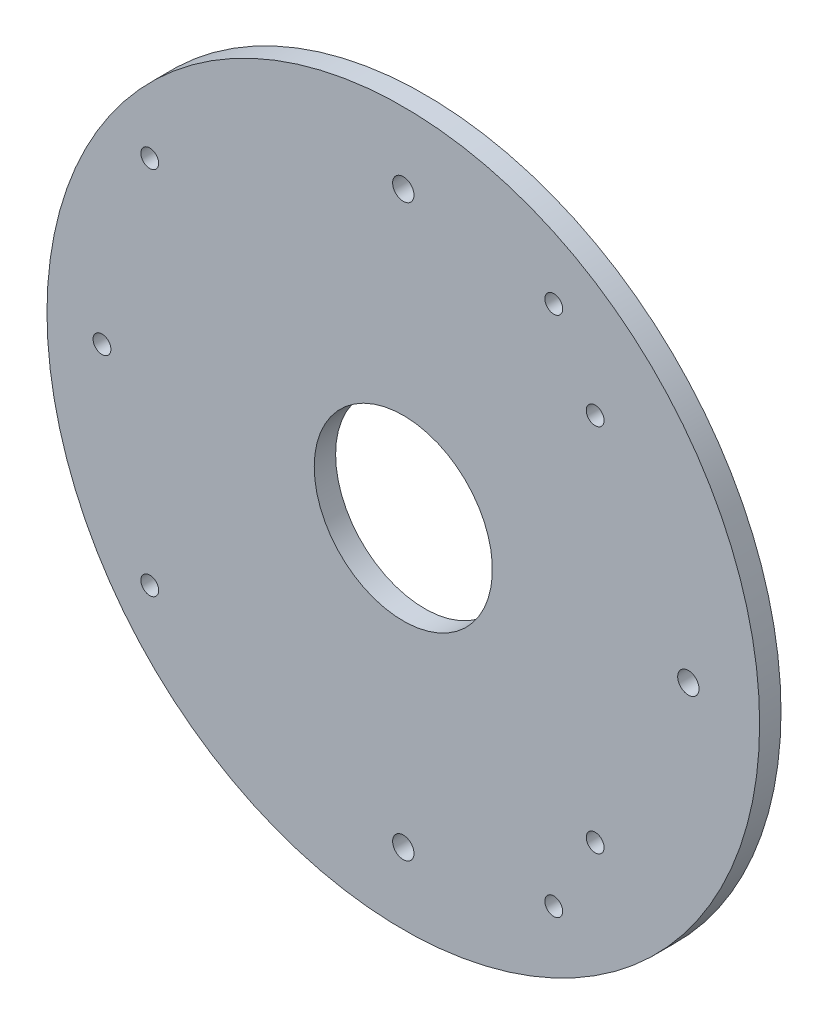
ISO-10303-21;
HEADER;
FILE_DESCRIPTION(('STEP AP214'),'2;1');
FILE_NAME('part.step','',(''),(''),'','','');
FILE_SCHEMA(('AUTOMOTIVE_DESIGN { 1 0 10303 214 1 1 1 1 }'));
ENDSEC;
DATA;
#1=APPLICATION_CONTEXT('core data for automotive mechanical design processes');
#2=APPLICATION_PROTOCOL_DEFINITION('international standard','automotive_design',2000,#1);
#3=PRODUCT_CONTEXT('',#1,'mechanical');
#4=PRODUCT('Part','Part','',(#3));
#5=PRODUCT_RELATED_PRODUCT_CATEGORY('part','',(#4));
#6=PRODUCT_DEFINITION_FORMATION('','',#4);
#7=PRODUCT_DEFINITION_CONTEXT('part definition',#1,'design');
#8=PRODUCT_DEFINITION('design','',#6,#7);
#9=PRODUCT_DEFINITION_SHAPE('','',#8);
#10=(LENGTH_UNIT() NAMED_UNIT(*) SI_UNIT(.MILLI.,.METRE.));
#11=(NAMED_UNIT(*) PLANE_ANGLE_UNIT() SI_UNIT($,.RADIAN.));
#12=(NAMED_UNIT(*) SI_UNIT($,.STERADIAN.) SOLID_ANGLE_UNIT());
#13=UNCERTAINTY_MEASURE_WITH_UNIT(LENGTH_MEASURE(1.E-05),#10,'distance_accuracy_value','');
#14=(GEOMETRIC_REPRESENTATION_CONTEXT(3) GLOBAL_UNCERTAINTY_ASSIGNED_CONTEXT((#13)) GLOBAL_UNIT_ASSIGNED_CONTEXT((#10,
#11,#12)) REPRESENTATION_CONTEXT('',''));
#15=CARTESIAN_POINT('',(0.,0.,0.));
#16=DIRECTION('',(0.,0.,1.));
#17=DIRECTION('',(1.,0.,0.));
#18=AXIS2_PLACEMENT_3D('',#15,#16,#17);
#19=CARTESIAN_POINT('',(0.,0.,3.81));
#20=DIRECTION('',(0.,0.,-1.));
#21=DIRECTION('',(-1.,0.,0.));
#22=AXIS2_PLACEMENT_3D('',#19,#20,#21);
#23=CYLINDRICAL_SURFACE('',#22,15.875);
#24=CARTESIAN_POINT('',(0.,0.,3.81));
#25=DIRECTION('',(0.,0.,1.));
#26=DIRECTION('',(1.,0.,0.));
#27=AXIS2_PLACEMENT_3D('',#24,#25,#26);
#28=CIRCLE('',#27,15.875);
#29=CARTESIAN_POINT('',(-15.875,0.,3.81));
#30=VERTEX_POINT('',#29);
#31=EDGE_CURVE('E40',#30,#30,#28,.T.);
#32=CARTESIAN_POINT('',(0.,0.,0.));
#33=DIRECTION('',(0.,0.,1.));
#34=DIRECTION('',(1.,0.,0.));
#35=AXIS2_PLACEMENT_3D('',#32,#33,#34);
#36=CIRCLE('',#35,15.875);
#37=CARTESIAN_POINT('',(-15.875,0.,0.));
#38=VERTEX_POINT('',#37);
#39=EDGE_CURVE('E70',#38,#38,#36,.T.);
#40=CARTESIAN_POINT('',(-15.875,0.,3.81));
#41=CARTESIAN_POINT('',(-15.875,0.,3.7703125));
#42=CARTESIAN_POINT('',(-15.875,0.,3.730625));
#43=CARTESIAN_POINT('',(-15.875,0.,3.65125));
#44=CARTESIAN_POINT('',(-15.875,0.,3.6115625));
#45=CARTESIAN_POINT('',(-15.875,0.,3.5321875));
#46=CARTESIAN_POINT('',(-15.875,0.,3.4925));
#47=CARTESIAN_POINT('',(-15.875,0.,3.413125));
#48=CARTESIAN_POINT('',(-15.875,0.,3.3734375));
#49=CARTESIAN_POINT('',(-15.875,0.,3.2940625));
#50=CARTESIAN_POINT('',(-15.875,0.,3.254375));
#51=CARTESIAN_POINT('',(-15.875,0.,3.175));
#52=CARTESIAN_POINT('',(-15.875,0.,3.1353125));
#53=CARTESIAN_POINT('',(-15.875,0.,3.0559375));
#54=CARTESIAN_POINT('',(-15.875,0.,3.01625));
#55=CARTESIAN_POINT('',(-15.875,0.,2.936875));
#56=CARTESIAN_POINT('',(-15.875,0.,2.8971875));
#57=CARTESIAN_POINT('',(-15.875,0.,2.8178125));
#58=CARTESIAN_POINT('',(-15.875,0.,2.778125));
#59=CARTESIAN_POINT('',(-15.875,0.,2.69875));
#60=CARTESIAN_POINT('',(-15.875,0.,2.6590625));
#61=CARTESIAN_POINT('',(-15.875,0.,2.5796875));
#62=CARTESIAN_POINT('',(-15.875,0.,2.54));
#63=CARTESIAN_POINT('',(-15.875,0.,2.460625));
#64=CARTESIAN_POINT('',(-15.875,0.,2.4209375));
#65=CARTESIAN_POINT('',(-15.875,0.,2.3415625));
#66=CARTESIAN_POINT('',(-15.875,0.,2.301875));
#67=CARTESIAN_POINT('',(-15.875,0.,2.2225));
#68=CARTESIAN_POINT('',(-15.875,0.,2.1828125));
#69=CARTESIAN_POINT('',(-15.875,0.,2.1034375));
#70=CARTESIAN_POINT('',(-15.875,0.,2.06375));
#71=CARTESIAN_POINT('',(-15.875,0.,1.984375));
#72=CARTESIAN_POINT('',(-15.875,0.,1.9446875));
#73=CARTESIAN_POINT('',(-15.875,0.,1.8653125));
#74=CARTESIAN_POINT('',(-15.875,0.,1.825625));
#75=CARTESIAN_POINT('',(-15.875,0.,1.74625));
#76=CARTESIAN_POINT('',(-15.875,0.,1.7065625));
#77=CARTESIAN_POINT('',(-15.875,0.,1.6271875));
#78=CARTESIAN_POINT('',(-15.875,0.,1.5875));
#79=CARTESIAN_POINT('',(-15.875,0.,1.508125));
#80=CARTESIAN_POINT('',(-15.875,0.,1.4684375));
#81=CARTESIAN_POINT('',(-15.875,0.,1.3890625));
#82=CARTESIAN_POINT('',(-15.875,0.,1.349375));
#83=CARTESIAN_POINT('',(-15.875,0.,1.27));
#84=CARTESIAN_POINT('',(-15.875,0.,1.2303125));
#85=CARTESIAN_POINT('',(-15.875,0.,1.1509375));
#86=CARTESIAN_POINT('',(-15.875,0.,1.11125));
#87=CARTESIAN_POINT('',(-15.875,0.,1.031875));
#88=CARTESIAN_POINT('',(-15.875,0.,0.9921875));
#89=CARTESIAN_POINT('',(-15.875,0.,0.9128125));
#90=CARTESIAN_POINT('',(-15.875,0.,0.873125));
#91=CARTESIAN_POINT('',(-15.875,0.,0.79375));
#92=CARTESIAN_POINT('',(-15.875,0.,0.7540625));
#93=CARTESIAN_POINT('',(-15.875,0.,0.6746875));
#94=CARTESIAN_POINT('',(-15.875,0.,0.635));
#95=CARTESIAN_POINT('',(-15.875,0.,0.555625));
#96=CARTESIAN_POINT('',(-15.875,0.,0.5159375));
#97=CARTESIAN_POINT('',(-15.875,0.,0.4365625));
#98=CARTESIAN_POINT('',(-15.875,0.,0.396875));
#99=CARTESIAN_POINT('',(-15.875,0.,0.3175));
#100=CARTESIAN_POINT('',(-15.875,0.,0.2778125));
#101=CARTESIAN_POINT('',(-15.875,0.,0.1984375));
#102=CARTESIAN_POINT('',(-15.875,0.,0.15875));
#103=CARTESIAN_POINT('',(-15.875,0.,0.0793749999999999));
#104=CARTESIAN_POINT('',(-15.875,0.,0.0396874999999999));
#105=CARTESIAN_POINT('',(-15.875,0.,0.));
#106=B_SPLINE_CURVE_WITH_KNOTS('',3,(#40,#41,#42,#43,#44,#45,#46,#47,#48,#49,#50,#51,#52,#53,
#54,#55,#56,#57,#58,#59,#60,#61,#62,#63,#64,#65,#66,#67,#68,#69,#70,#71,#72,#73,#74,#75,#76,#77,
#78,#79,#80,#81,#82,#83,#84,#85,#86,#87,#88,#89,#90,#91,#92,#93,#94,#95,#96,#97,#98,#99,#100,
#101,#102,#103,#104,#105),.UNSPECIFIED.,.F.,.F.,(4,2,2,2,2,2,2,2,2,2,2,2,2,2,2,2,2,2,2,2,2,2,2,
2,2,2,2,2,2,2,2,2,4),(0.,0.1190625,0.238125,0.3571875,0.47625,0.5953125,0.714375,0.8334375,
0.9525,1.0715625,1.190625,1.3096875,1.42875,1.5478125,1.666875,1.7859375,1.905,2.0240625,
2.143125,2.2621875,2.38125,2.5003125,2.619375,2.7384375,2.8575,2.9765625,3.095625,3.2146875,
3.33375,3.4528125,3.571875,3.6909375,3.81),.UNSPECIFIED.);
#107=EDGE_CURVE('BSEAM32',#30,#38,#106,.T.);
#108=ORIENTED_EDGE('',*,*,#31,.T.);
#109=ORIENTED_EDGE('',*,*,#39,.F.);
#110=ORIENTED_EDGE('',*,*,#107,.T.);
#111=ORIENTED_EDGE('',*,*,#107,.F.);
#112=EDGE_LOOP('',(#108,#110,#109,#111));
#113=FACE_BOUND('',#112,.T.);
#114=ADVANCED_FACE('F32',(#113),#23,.F.);
#115=CARTESIAN_POINT('',(0.,50.8,3.81));
#116=DIRECTION('',(0.,0.,-1.));
#117=DIRECTION('',(-1.,0.,0.));
#118=AXIS2_PLACEMENT_3D('',#115,#116,#117);
#119=CYLINDRICAL_SURFACE('',#118,1.905);
#120=CARTESIAN_POINT('',(0.,50.8,3.81));
#121=DIRECTION('',(0.,0.,1.));
#122=DIRECTION('',(1.,0.,0.));
#123=AXIS2_PLACEMENT_3D('',#120,#121,#122);
#124=CIRCLE('',#123,1.905);
#125=CARTESIAN_POINT('',(-1.905,50.8,3.81));
#126=VERTEX_POINT('',#125);
#127=EDGE_CURVE('E45',#126,#126,#124,.T.);
#128=CARTESIAN_POINT('',(0.,50.8,0.));
#129=DIRECTION('',(0.,0.,1.));
#130=DIRECTION('',(1.,0.,0.));
#131=AXIS2_PLACEMENT_3D('',#128,#129,#130);
#132=CIRCLE('',#131,1.905);
#133=CARTESIAN_POINT('',(-1.905,50.8,0.));
#134=VERTEX_POINT('',#133);
#135=EDGE_CURVE('E68',#134,#134,#132,.T.);
#136=CARTESIAN_POINT('',(-1.905,50.8,3.81));
#137=CARTESIAN_POINT('',(-1.905,50.8,3.7703125));
#138=CARTESIAN_POINT('',(-1.905,50.8,3.730625));
#139=CARTESIAN_POINT('',(-1.905,50.8,3.65125));
#140=CARTESIAN_POINT('',(-1.905,50.8,3.6115625));
#141=CARTESIAN_POINT('',(-1.905,50.8,3.5321875));
#142=CARTESIAN_POINT('',(-1.905,50.8,3.4925));
#143=CARTESIAN_POINT('',(-1.905,50.8,3.413125));
#144=CARTESIAN_POINT('',(-1.905,50.8,3.3734375));
#145=CARTESIAN_POINT('',(-1.905,50.8,3.2940625));
#146=CARTESIAN_POINT('',(-1.905,50.8,3.254375));
#147=CARTESIAN_POINT('',(-1.905,50.8,3.175));
#148=CARTESIAN_POINT('',(-1.905,50.8,3.1353125));
#149=CARTESIAN_POINT('',(-1.905,50.8,3.0559375));
#150=CARTESIAN_POINT('',(-1.905,50.8,3.01625));
#151=CARTESIAN_POINT('',(-1.905,50.8,2.936875));
#152=CARTESIAN_POINT('',(-1.905,50.8,2.8971875));
#153=CARTESIAN_POINT('',(-1.905,50.8,2.8178125));
#154=CARTESIAN_POINT('',(-1.905,50.8,2.778125));
#155=CARTESIAN_POINT('',(-1.905,50.8,2.69875));
#156=CARTESIAN_POINT('',(-1.905,50.8,2.6590625));
#157=CARTESIAN_POINT('',(-1.905,50.8,2.5796875));
#158=CARTESIAN_POINT('',(-1.905,50.8,2.54));
#159=CARTESIAN_POINT('',(-1.905,50.8,2.460625));
#160=CARTESIAN_POINT('',(-1.905,50.8,2.4209375));
#161=CARTESIAN_POINT('',(-1.905,50.8,2.3415625));
#162=CARTESIAN_POINT('',(-1.905,50.8,2.301875));
#163=CARTESIAN_POINT('',(-1.905,50.8,2.2225));
#164=CARTESIAN_POINT('',(-1.905,50.8,2.1828125));
#165=CARTESIAN_POINT('',(-1.905,50.8,2.1034375));
#166=CARTESIAN_POINT('',(-1.905,50.8,2.06375));
#167=CARTESIAN_POINT('',(-1.905,50.8,1.984375));
#168=CARTESIAN_POINT('',(-1.905,50.8,1.9446875));
#169=CARTESIAN_POINT('',(-1.905,50.8,1.8653125));
#170=CARTESIAN_POINT('',(-1.905,50.8,1.825625));
#171=CARTESIAN_POINT('',(-1.905,50.8,1.74625));
#172=CARTESIAN_POINT('',(-1.905,50.8,1.7065625));
#173=CARTESIAN_POINT('',(-1.905,50.8,1.6271875));
#174=CARTESIAN_POINT('',(-1.905,50.8,1.5875));
#175=CARTESIAN_POINT('',(-1.905,50.8,1.508125));
#176=CARTESIAN_POINT('',(-1.905,50.8,1.4684375));
#177=CARTESIAN_POINT('',(-1.905,50.8,1.3890625));
#178=CARTESIAN_POINT('',(-1.905,50.8,1.349375));
#179=CARTESIAN_POINT('',(-1.905,50.8,1.27));
#180=CARTESIAN_POINT('',(-1.905,50.8,1.2303125));
#181=CARTESIAN_POINT('',(-1.905,50.8,1.1509375));
#182=CARTESIAN_POINT('',(-1.905,50.8,1.11125));
#183=CARTESIAN_POINT('',(-1.905,50.8,1.031875));
#184=CARTESIAN_POINT('',(-1.905,50.8,0.9921875));
#185=CARTESIAN_POINT('',(-1.905,50.8,0.9128125));
#186=CARTESIAN_POINT('',(-1.905,50.8,0.873125));
#187=CARTESIAN_POINT('',(-1.905,50.8,0.79375));
#188=CARTESIAN_POINT('',(-1.905,50.8,0.7540625));
#189=CARTESIAN_POINT('',(-1.905,50.8,0.6746875));
#190=CARTESIAN_POINT('',(-1.905,50.8,0.635));
#191=CARTESIAN_POINT('',(-1.905,50.8,0.555625));
#192=CARTESIAN_POINT('',(-1.905,50.8,0.5159375));
#193=CARTESIAN_POINT('',(-1.905,50.8,0.4365625));
#194=CARTESIAN_POINT('',(-1.905,50.8,0.396875));
#195=CARTESIAN_POINT('',(-1.905,50.8,0.3175));
#196=CARTESIAN_POINT('',(-1.905,50.8,0.2778125));
#197=CARTESIAN_POINT('',(-1.905,50.8,0.1984375));
#198=CARTESIAN_POINT('',(-1.905,50.8,0.15875));
#199=CARTESIAN_POINT('',(-1.905,50.8,0.0793749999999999));
#200=CARTESIAN_POINT('',(-1.905,50.8,0.0396874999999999));
#201=CARTESIAN_POINT('',(-1.905,50.8,0.));
#202=B_SPLINE_CURVE_WITH_KNOTS('',3,(#136,#137,#138,#139,#140,#141,#142,#143,#144,#145,#146,
#147,#148,#149,#150,#151,#152,#153,#154,#155,#156,#157,#158,#159,#160,#161,#162,#163,#164,#165,
#166,#167,#168,#169,#170,#171,#172,#173,#174,#175,#176,#177,#178,#179,#180,#181,#182,#183,#184,
#185,#186,#187,#188,#189,#190,#191,#192,#193,#194,#195,#196,#197,#198,#199,#200,#201),
.UNSPECIFIED.,.F.,.F.,(4,2,2,2,2,2,2,2,2,2,2,2,2,2,2,2,2,2,2,2,2,2,2,2,2,2,2,2,2,2,2,2,4),(0.,
0.1190625,0.238125,0.3571875,0.47625,0.5953125,0.714375,0.8334375,0.9525,1.0715625,1.190625,
1.3096875,1.42875,1.5478125,1.666875,1.7859375,1.905,2.0240625,2.143125,2.2621875,2.38125,
2.5003125,2.619375,2.7384375,2.8575,2.9765625,3.095625,3.2146875,3.33375,3.4528125,3.571875,
3.6909375,3.81),.UNSPECIFIED.);
#203=EDGE_CURVE('BSEAM103',#126,#134,#202,.T.);
#204=ORIENTED_EDGE('',*,*,#127,.T.);
#205=ORIENTED_EDGE('',*,*,#135,.F.);
#206=ORIENTED_EDGE('',*,*,#203,.T.);
#207=ORIENTED_EDGE('',*,*,#203,.F.);
#208=EDGE_LOOP('',(#204,#206,#205,#207));
#209=FACE_BOUND('',#208,.T.);
#210=ADVANCED_FACE('F103',(#209),#119,.F.);
#211=CARTESIAN_POINT('',(50.8,-1.77367252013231E-13,3.81));
#212=DIRECTION('',(0.,0.,-1.));
#213=DIRECTION('',(-1.,0.,0.));
#214=AXIS2_PLACEMENT_3D('',#211,#212,#213);
#215=CYLINDRICAL_SURFACE('',#214,1.905);
#216=CARTESIAN_POINT('',(50.8,-1.77367252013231E-13,3.81));
#217=DIRECTION('',(0.,0.,1.));
#218=DIRECTION('',(1.,0.,0.));
#219=AXIS2_PLACEMENT_3D('',#216,#217,#218);
#220=CIRCLE('',#219,1.905);
#221=CARTESIAN_POINT('',(48.895,-1.77367252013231E-13,3.81));
#222=VERTEX_POINT('',#221);
#223=EDGE_CURVE('E98',#222,#222,#220,.T.);
#224=CARTESIAN_POINT('',(50.8,-1.77367252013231E-13,0.));
#225=DIRECTION('',(0.,0.,1.));
#226=DIRECTION('',(1.,0.,0.));
#227=AXIS2_PLACEMENT_3D('',#224,#225,#226);
#228=CIRCLE('',#227,1.905);
#229=CARTESIAN_POINT('',(48.895,-1.77367252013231E-13,0.));
#230=VERTEX_POINT('',#229);
#231=EDGE_CURVE('E65',#230,#230,#228,.T.);
#232=CARTESIAN_POINT('',(48.895,-1.77367252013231E-13,3.81));
#233=CARTESIAN_POINT('',(48.895,-1.77367252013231E-13,3.7703125));
#234=CARTESIAN_POINT('',(48.895,-1.77367252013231E-13,3.730625));
#235=CARTESIAN_POINT('',(48.895,-1.77367252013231E-13,3.65125));
#236=CARTESIAN_POINT('',(48.895,-1.77367252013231E-13,3.6115625));
#237=CARTESIAN_POINT('',(48.895,-1.77367252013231E-13,3.5321875));
#238=CARTESIAN_POINT('',(48.895,-1.77367252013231E-13,3.4925));
#239=CARTESIAN_POINT('',(48.895,-1.77367252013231E-13,3.413125));
#240=CARTESIAN_POINT('',(48.895,-1.77367252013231E-13,3.3734375));
#241=CARTESIAN_POINT('',(48.895,-1.77367252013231E-13,3.2940625));
#242=CARTESIAN_POINT('',(48.895,-1.77367252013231E-13,3.254375));
#243=CARTESIAN_POINT('',(48.895,-1.77367252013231E-13,3.175));
#244=CARTESIAN_POINT('',(48.895,-1.77367252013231E-13,3.1353125));
#245=CARTESIAN_POINT('',(48.895,-1.77367252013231E-13,3.0559375));
#246=CARTESIAN_POINT('',(48.895,-1.77367252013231E-13,3.01625));
#247=CARTESIAN_POINT('',(48.895,-1.77367252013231E-13,2.936875));
#248=CARTESIAN_POINT('',(48.895,-1.77367252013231E-13,2.8971875));
#249=CARTESIAN_POINT('',(48.895,-1.77367252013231E-13,2.8178125));
#250=CARTESIAN_POINT('',(48.895,-1.77367252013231E-13,2.778125));
#251=CARTESIAN_POINT('',(48.895,-1.77367252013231E-13,2.69875));
#252=CARTESIAN_POINT('',(48.895,-1.77367252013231E-13,2.6590625));
#253=CARTESIAN_POINT('',(48.895,-1.77367252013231E-13,2.5796875));
#254=CARTESIAN_POINT('',(48.895,-1.77367252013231E-13,2.54));
#255=CARTESIAN_POINT('',(48.895,-1.77367252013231E-13,2.460625));
#256=CARTESIAN_POINT('',(48.895,-1.77367252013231E-13,2.4209375));
#257=CARTESIAN_POINT('',(48.895,-1.77367252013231E-13,2.3415625));
#258=CARTESIAN_POINT('',(48.895,-1.77367252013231E-13,2.301875));
#259=CARTESIAN_POINT('',(48.895,-1.77367252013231E-13,2.2225));
#260=CARTESIAN_POINT('',(48.895,-1.77367252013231E-13,2.1828125));
#261=CARTESIAN_POINT('',(48.895,-1.77367252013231E-13,2.1034375));
#262=CARTESIAN_POINT('',(48.895,-1.77367252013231E-13,2.06375));
#263=CARTESIAN_POINT('',(48.895,-1.77367252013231E-13,1.984375));
#264=CARTESIAN_POINT('',(48.895,-1.77367252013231E-13,1.9446875));
#265=CARTESIAN_POINT('',(48.895,-1.77367252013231E-13,1.8653125));
#266=CARTESIAN_POINT('',(48.895,-1.77367252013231E-13,1.825625));
#267=CARTESIAN_POINT('',(48.895,-1.77367252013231E-13,1.74625));
#268=CARTESIAN_POINT('',(48.895,-1.77367252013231E-13,1.7065625));
#269=CARTESIAN_POINT('',(48.895,-1.77367252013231E-13,1.6271875));
#270=CARTESIAN_POINT('',(48.895,-1.77367252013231E-13,1.5875));
#271=CARTESIAN_POINT('',(48.895,-1.77367252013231E-13,1.508125));
#272=CARTESIAN_POINT('',(48.895,-1.77367252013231E-13,1.4684375));
#273=CARTESIAN_POINT('',(48.895,-1.77367252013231E-13,1.3890625));
#274=CARTESIAN_POINT('',(48.895,-1.77367252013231E-13,1.349375));
#275=CARTESIAN_POINT('',(48.895,-1.77367252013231E-13,1.27));
#276=CARTESIAN_POINT('',(48.895,-1.77367252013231E-13,1.2303125));
#277=CARTESIAN_POINT('',(48.895,-1.77367252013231E-13,1.1509375));
#278=CARTESIAN_POINT('',(48.895,-1.77367252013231E-13,1.11125));
#279=CARTESIAN_POINT('',(48.895,-1.77367252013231E-13,1.031875));
#280=CARTESIAN_POINT('',(48.895,-1.77367252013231E-13,0.9921875));
#281=CARTESIAN_POINT('',(48.895,-1.77367252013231E-13,0.9128125));
#282=CARTESIAN_POINT('',(48.895,-1.77367252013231E-13,0.873125));
#283=CARTESIAN_POINT('',(48.895,-1.77367252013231E-13,0.79375));
#284=CARTESIAN_POINT('',(48.895,-1.77367252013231E-13,0.7540625));
#285=CARTESIAN_POINT('',(48.895,-1.77367252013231E-13,0.6746875));
#286=CARTESIAN_POINT('',(48.895,-1.77367252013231E-13,0.635));
#287=CARTESIAN_POINT('',(48.895,-1.77367252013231E-13,0.555625));
#288=CARTESIAN_POINT('',(48.895,-1.77367252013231E-13,0.5159375));
#289=CARTESIAN_POINT('',(48.895,-1.77367252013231E-13,0.4365625));
#290=CARTESIAN_POINT('',(48.895,-1.77367252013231E-13,0.396875));
#291=CARTESIAN_POINT('',(48.895,-1.77367252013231E-13,0.3175));
#292=CARTESIAN_POINT('',(48.895,-1.77367252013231E-13,0.2778125));
#293=CARTESIAN_POINT('',(48.895,-1.77367252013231E-13,0.1984375));
#294=CARTESIAN_POINT('',(48.895,-1.77367252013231E-13,0.15875));
#295=CARTESIAN_POINT('',(48.895,-1.77367252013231E-13,0.0793749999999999));
#296=CARTESIAN_POINT('',(48.895,-1.77367252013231E-13,0.0396874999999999));
#297=CARTESIAN_POINT('',(48.895,-1.77367252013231E-13,0.));
#298=B_SPLINE_CURVE_WITH_KNOTS('',3,(#232,#233,#234,#235,#236,#237,#238,#239,#240,#241,#242,
#243,#244,#245,#246,#247,#248,#249,#250,#251,#252,#253,#254,#255,#256,#257,#258,#259,#260,#261,
#262,#263,#264,#265,#266,#267,#268,#269,#270,#271,#272,#273,#274,#275,#276,#277,#278,#279,#280,
#281,#282,#283,#284,#285,#286,#287,#288,#289,#290,#291,#292,#293,#294,#295,#296,#297),
.UNSPECIFIED.,.F.,.F.,(4,2,2,2,2,2,2,2,2,2,2,2,2,2,2,2,2,2,2,2,2,2,2,2,2,2,2,2,2,2,2,2,4),(0.,
0.1190625,0.238125,0.3571875,0.47625,0.5953125,0.714375,0.8334375,0.9525,1.0715625,1.190625,
1.3096875,1.42875,1.5478125,1.666875,1.7859375,1.905,2.0240625,2.143125,2.2621875,2.38125,
2.5003125,2.619375,2.7384375,2.8575,2.9765625,3.095625,3.2146875,3.33375,3.4528125,3.571875,
3.6909375,3.81),.UNSPECIFIED.);
#299=EDGE_CURVE('BSEAM121',#222,#230,#298,.T.);
#300=ORIENTED_EDGE('',*,*,#223,.T.);
#301=ORIENTED_EDGE('',*,*,#231,.F.);
#302=ORIENTED_EDGE('',*,*,#299,.T.);
#303=ORIENTED_EDGE('',*,*,#299,.F.);
#304=EDGE_LOOP('',(#300,#302,#301,#303));
#305=FACE_BOUND('',#304,.T.);
#306=ADVANCED_FACE('F121',(#305),#215,.F.);
#307=CARTESIAN_POINT('',(-3.54734504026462E-13,-50.8,3.81));
#308=DIRECTION('',(0.,0.,-1.));
#309=DIRECTION('',(-1.,0.,0.));
#310=AXIS2_PLACEMENT_3D('',#307,#308,#309);
#311=CYLINDRICAL_SURFACE('',#310,1.905);
#312=CARTESIAN_POINT('',(-3.54734504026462E-13,-50.8,3.81));
#313=DIRECTION('',(0.,0.,1.));
#314=DIRECTION('',(1.,0.,0.));
#315=AXIS2_PLACEMENT_3D('',#312,#313,#314);
#316=CIRCLE('',#315,1.905);
#317=CARTESIAN_POINT('',(-1.90500000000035,-50.8,3.81));
#318=VERTEX_POINT('',#317);
#319=EDGE_CURVE('E95',#318,#318,#316,.T.);
#320=CARTESIAN_POINT('',(-3.54734504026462E-13,-50.8,0.));
#321=DIRECTION('',(0.,0.,1.));
#322=DIRECTION('',(1.,0.,0.));
#323=AXIS2_PLACEMENT_3D('',#320,#321,#322);
#324=CIRCLE('',#323,1.905);
#325=CARTESIAN_POINT('',(-1.90500000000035,-50.8,0.));
#326=VERTEX_POINT('',#325);
#327=EDGE_CURVE('E62',#326,#326,#324,.T.);
#328=CARTESIAN_POINT('',(-1.90500000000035,-50.8,3.81));
#329=CARTESIAN_POINT('',(-1.90500000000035,-50.8,3.7703125));
#330=CARTESIAN_POINT('',(-1.90500000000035,-50.8,3.730625));
#331=CARTESIAN_POINT('',(-1.90500000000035,-50.8,3.65125));
#332=CARTESIAN_POINT('',(-1.90500000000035,-50.8,3.6115625));
#333=CARTESIAN_POINT('',(-1.90500000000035,-50.8,3.5321875));
#334=CARTESIAN_POINT('',(-1.90500000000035,-50.8,3.4925));
#335=CARTESIAN_POINT('',(-1.90500000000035,-50.8,3.413125));
#336=CARTESIAN_POINT('',(-1.90500000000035,-50.8,3.3734375));
#337=CARTESIAN_POINT('',(-1.90500000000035,-50.8,3.2940625));
#338=CARTESIAN_POINT('',(-1.90500000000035,-50.8,3.254375));
#339=CARTESIAN_POINT('',(-1.90500000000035,-50.8,3.175));
#340=CARTESIAN_POINT('',(-1.90500000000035,-50.8,3.1353125));
#341=CARTESIAN_POINT('',(-1.90500000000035,-50.8,3.0559375));
#342=CARTESIAN_POINT('',(-1.90500000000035,-50.8,3.01625));
#343=CARTESIAN_POINT('',(-1.90500000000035,-50.8,2.936875));
#344=CARTESIAN_POINT('',(-1.90500000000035,-50.8,2.8971875));
#345=CARTESIAN_POINT('',(-1.90500000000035,-50.8,2.8178125));
#346=CARTESIAN_POINT('',(-1.90500000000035,-50.8,2.778125));
#347=CARTESIAN_POINT('',(-1.90500000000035,-50.8,2.69875));
#348=CARTESIAN_POINT('',(-1.90500000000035,-50.8,2.6590625));
#349=CARTESIAN_POINT('',(-1.90500000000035,-50.8,2.5796875));
#350=CARTESIAN_POINT('',(-1.90500000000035,-50.8,2.54));
#351=CARTESIAN_POINT('',(-1.90500000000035,-50.8,2.460625));
#352=CARTESIAN_POINT('',(-1.90500000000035,-50.8,2.4209375));
#353=CARTESIAN_POINT('',(-1.90500000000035,-50.8,2.3415625));
#354=CARTESIAN_POINT('',(-1.90500000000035,-50.8,2.301875));
#355=CARTESIAN_POINT('',(-1.90500000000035,-50.8,2.2225));
#356=CARTESIAN_POINT('',(-1.90500000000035,-50.8,2.1828125));
#357=CARTESIAN_POINT('',(-1.90500000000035,-50.8,2.1034375));
#358=CARTESIAN_POINT('',(-1.90500000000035,-50.8,2.06375));
#359=CARTESIAN_POINT('',(-1.90500000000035,-50.8,1.984375));
#360=CARTESIAN_POINT('',(-1.90500000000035,-50.8,1.9446875));
#361=CARTESIAN_POINT('',(-1.90500000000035,-50.8,1.8653125));
#362=CARTESIAN_POINT('',(-1.90500000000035,-50.8,1.825625));
#363=CARTESIAN_POINT('',(-1.90500000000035,-50.8,1.74625));
#364=CARTESIAN_POINT('',(-1.90500000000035,-50.8,1.7065625));
#365=CARTESIAN_POINT('',(-1.90500000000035,-50.8,1.6271875));
#366=CARTESIAN_POINT('',(-1.90500000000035,-50.8,1.5875));
#367=CARTESIAN_POINT('',(-1.90500000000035,-50.8,1.508125));
#368=CARTESIAN_POINT('',(-1.90500000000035,-50.8,1.4684375));
#369=CARTESIAN_POINT('',(-1.90500000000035,-50.8,1.3890625));
#370=CARTESIAN_POINT('',(-1.90500000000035,-50.8,1.349375));
#371=CARTESIAN_POINT('',(-1.90500000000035,-50.8,1.27));
#372=CARTESIAN_POINT('',(-1.90500000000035,-50.8,1.2303125));
#373=CARTESIAN_POINT('',(-1.90500000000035,-50.8,1.1509375));
#374=CARTESIAN_POINT('',(-1.90500000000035,-50.8,1.11125));
#375=CARTESIAN_POINT('',(-1.90500000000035,-50.8,1.031875));
#376=CARTESIAN_POINT('',(-1.90500000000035,-50.8,0.9921875));
#377=CARTESIAN_POINT('',(-1.90500000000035,-50.8,0.9128125));
#378=CARTESIAN_POINT('',(-1.90500000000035,-50.8,0.873125));
#379=CARTESIAN_POINT('',(-1.90500000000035,-50.8,0.79375));
#380=CARTESIAN_POINT('',(-1.90500000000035,-50.8,0.7540625));
#381=CARTESIAN_POINT('',(-1.90500000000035,-50.8,0.6746875));
#382=CARTESIAN_POINT('',(-1.90500000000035,-50.8,0.635));
#383=CARTESIAN_POINT('',(-1.90500000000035,-50.8,0.555625));
#384=CARTESIAN_POINT('',(-1.90500000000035,-50.8,0.5159375));
#385=CARTESIAN_POINT('',(-1.90500000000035,-50.8,0.4365625));
#386=CARTESIAN_POINT('',(-1.90500000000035,-50.8,0.396875));
#387=CARTESIAN_POINT('',(-1.90500000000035,-50.8,0.3175));
#388=CARTESIAN_POINT('',(-1.90500000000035,-50.8,0.2778125));
#389=CARTESIAN_POINT('',(-1.90500000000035,-50.8,0.1984375));
#390=CARTESIAN_POINT('',(-1.90500000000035,-50.8,0.15875));
#391=CARTESIAN_POINT('',(-1.90500000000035,-50.8,0.0793749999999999));
#392=CARTESIAN_POINT('',(-1.90500000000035,-50.8,0.0396874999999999));
#393=CARTESIAN_POINT('',(-1.90500000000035,-50.8,0.));
#394=B_SPLINE_CURVE_WITH_KNOTS('',3,(#328,#329,#330,#331,#332,#333,#334,#335,#336,#337,#338,
#339,#340,#341,#342,#343,#344,#345,#346,#347,#348,#349,#350,#351,#352,#353,#354,#355,#356,#357,
#358,#359,#360,#361,#362,#363,#364,#365,#366,#367,#368,#369,#370,#371,#372,#373,#374,#375,#376,
#377,#378,#379,#380,#381,#382,#383,#384,#385,#386,#387,#388,#389,#390,#391,#392,#393),
.UNSPECIFIED.,.F.,.F.,(4,2,2,2,2,2,2,2,2,2,2,2,2,2,2,2,2,2,2,2,2,2,2,2,2,2,2,2,2,2,2,2,4),(0.,
0.1190625,0.238125,0.3571875,0.47625,0.5953125,0.714375,0.8334375,0.9525,1.0715625,1.190625,
1.3096875,1.42875,1.5478125,1.666875,1.7859375,1.905,2.0240625,2.143125,2.2621875,2.38125,
2.5003125,2.619375,2.7384375,2.8575,2.9765625,3.095625,3.2146875,3.33375,3.4528125,3.571875,
3.6909375,3.81),.UNSPECIFIED.);
#395=EDGE_CURVE('BSEAM128',#318,#326,#394,.T.);
#396=ORIENTED_EDGE('',*,*,#319,.T.);
#397=ORIENTED_EDGE('',*,*,#327,.F.);
#398=ORIENTED_EDGE('',*,*,#395,.T.);
#399=ORIENTED_EDGE('',*,*,#395,.F.);
#400=EDGE_LOOP('',(#396,#398,#397,#399));
#401=FACE_BOUND('',#400,.T.);
#402=ADVANCED_FACE('F128',(#401),#311,.F.);
#403=CARTESIAN_POINT('',(-45.1846015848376,32.9565,3.81));
#404=DIRECTION('',(0.,0.,-1.));
#405=DIRECTION('',(-1.,0.,0.));
#406=AXIS2_PLACEMENT_3D('',#403,#404,#405);
#407=CYLINDRICAL_SURFACE('',#406,1.5875);
#408=CARTESIAN_POINT('',(-45.1846015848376,32.9565,3.81));
#409=DIRECTION('',(0.,0.,1.));
#410=DIRECTION('',(1.,0.,0.));
#411=AXIS2_PLACEMENT_3D('',#408,#409,#410);
#412=CIRCLE('',#411,1.5875);
#413=CARTESIAN_POINT('',(-46.7721015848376,32.9565,3.81));
#414=VERTEX_POINT('',#413);
#415=EDGE_CURVE('E92',#414,#414,#412,.T.);
#416=CARTESIAN_POINT('',(-45.1846015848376,32.9565,0.));
#417=DIRECTION('',(0.,0.,1.));
#418=DIRECTION('',(1.,0.,0.));
#419=AXIS2_PLACEMENT_3D('',#416,#417,#418);
#420=CIRCLE('',#419,1.5875);
#421=CARTESIAN_POINT('',(-46.7721015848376,32.9565,0.));
#422=VERTEX_POINT('',#421);
#423=EDGE_CURVE('E59',#422,#422,#420,.T.);
#424=CARTESIAN_POINT('',(-46.7721015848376,32.9565,3.81));
#425=CARTESIAN_POINT('',(-46.7721015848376,32.9565,3.7703125));
#426=CARTESIAN_POINT('',(-46.7721015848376,32.9565,3.730625));
#427=CARTESIAN_POINT('',(-46.7721015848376,32.9565,3.65125));
#428=CARTESIAN_POINT('',(-46.7721015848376,32.9565,3.6115625));
#429=CARTESIAN_POINT('',(-46.7721015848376,32.9565,3.5321875));
#430=CARTESIAN_POINT('',(-46.7721015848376,32.9565,3.4925));
#431=CARTESIAN_POINT('',(-46.7721015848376,32.9565,3.413125));
#432=CARTESIAN_POINT('',(-46.7721015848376,32.9565,3.3734375));
#433=CARTESIAN_POINT('',(-46.7721015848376,32.9565,3.2940625));
#434=CARTESIAN_POINT('',(-46.7721015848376,32.9565,3.254375));
#435=CARTESIAN_POINT('',(-46.7721015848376,32.9565,3.175));
#436=CARTESIAN_POINT('',(-46.7721015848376,32.9565,3.1353125));
#437=CARTESIAN_POINT('',(-46.7721015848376,32.9565,3.0559375));
#438=CARTESIAN_POINT('',(-46.7721015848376,32.9565,3.01625));
#439=CARTESIAN_POINT('',(-46.7721015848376,32.9565,2.936875));
#440=CARTESIAN_POINT('',(-46.7721015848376,32.9565,2.8971875));
#441=CARTESIAN_POINT('',(-46.7721015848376,32.9565,2.8178125));
#442=CARTESIAN_POINT('',(-46.7721015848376,32.9565,2.778125));
#443=CARTESIAN_POINT('',(-46.7721015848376,32.9565,2.69875));
#444=CARTESIAN_POINT('',(-46.7721015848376,32.9565,2.6590625));
#445=CARTESIAN_POINT('',(-46.7721015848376,32.9565,2.5796875));
#446=CARTESIAN_POINT('',(-46.7721015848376,32.9565,2.54));
#447=CARTESIAN_POINT('',(-46.7721015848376,32.9565,2.460625));
#448=CARTESIAN_POINT('',(-46.7721015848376,32.9565,2.4209375));
#449=CARTESIAN_POINT('',(-46.7721015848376,32.9565,2.3415625));
#450=CARTESIAN_POINT('',(-46.7721015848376,32.9565,2.301875));
#451=CARTESIAN_POINT('',(-46.7721015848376,32.9565,2.2225));
#452=CARTESIAN_POINT('',(-46.7721015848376,32.9565,2.1828125));
#453=CARTESIAN_POINT('',(-46.7721015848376,32.9565,2.1034375));
#454=CARTESIAN_POINT('',(-46.7721015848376,32.9565,2.06375));
#455=CARTESIAN_POINT('',(-46.7721015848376,32.9565,1.984375));
#456=CARTESIAN_POINT('',(-46.7721015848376,32.9565,1.9446875));
#457=CARTESIAN_POINT('',(-46.7721015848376,32.9565,1.8653125));
#458=CARTESIAN_POINT('',(-46.7721015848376,32.9565,1.825625));
#459=CARTESIAN_POINT('',(-46.7721015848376,32.9565,1.74625));
#460=CARTESIAN_POINT('',(-46.7721015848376,32.9565,1.7065625));
#461=CARTESIAN_POINT('',(-46.7721015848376,32.9565,1.6271875));
#462=CARTESIAN_POINT('',(-46.7721015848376,32.9565,1.5875));
#463=CARTESIAN_POINT('',(-46.7721015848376,32.9565,1.508125));
#464=CARTESIAN_POINT('',(-46.7721015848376,32.9565,1.4684375));
#465=CARTESIAN_POINT('',(-46.7721015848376,32.9565,1.3890625));
#466=CARTESIAN_POINT('',(-46.7721015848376,32.9565,1.349375));
#467=CARTESIAN_POINT('',(-46.7721015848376,32.9565,1.27));
#468=CARTESIAN_POINT('',(-46.7721015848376,32.9565,1.2303125));
#469=CARTESIAN_POINT('',(-46.7721015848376,32.9565,1.1509375));
#470=CARTESIAN_POINT('',(-46.7721015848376,32.9565,1.11125));
#471=CARTESIAN_POINT('',(-46.7721015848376,32.9565,1.031875));
#472=CARTESIAN_POINT('',(-46.7721015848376,32.9565,0.9921875));
#473=CARTESIAN_POINT('',(-46.7721015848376,32.9565,0.9128125));
#474=CARTESIAN_POINT('',(-46.7721015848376,32.9565,0.873125));
#475=CARTESIAN_POINT('',(-46.7721015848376,32.9565,0.79375));
#476=CARTESIAN_POINT('',(-46.7721015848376,32.9565,0.7540625));
#477=CARTESIAN_POINT('',(-46.7721015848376,32.9565,0.6746875));
#478=CARTESIAN_POINT('',(-46.7721015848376,32.9565,0.635));
#479=CARTESIAN_POINT('',(-46.7721015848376,32.9565,0.555625));
#480=CARTESIAN_POINT('',(-46.7721015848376,32.9565,0.5159375));
#481=CARTESIAN_POINT('',(-46.7721015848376,32.9565,0.4365625));
#482=CARTESIAN_POINT('',(-46.7721015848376,32.9565,0.396875));
#483=CARTESIAN_POINT('',(-46.7721015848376,32.9565,0.3175));
#484=CARTESIAN_POINT('',(-46.7721015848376,32.9565,0.2778125));
#485=CARTESIAN_POINT('',(-46.7721015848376,32.9565,0.1984375));
#486=CARTESIAN_POINT('',(-46.7721015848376,32.9565,0.15875));
#487=CARTESIAN_POINT('',(-46.7721015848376,32.9565,0.0793749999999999));
#488=CARTESIAN_POINT('',(-46.7721015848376,32.9565,0.0396874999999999));
#489=CARTESIAN_POINT('',(-46.7721015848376,32.9565,0.));
#490=B_SPLINE_CURVE_WITH_KNOTS('',3,(#424,#425,#426,#427,#428,#429,#430,#431,#432,#433,#434,
#435,#436,#437,#438,#439,#440,#441,#442,#443,#444,#445,#446,#447,#448,#449,#450,#451,#452,#453,
#454,#455,#456,#457,#458,#459,#460,#461,#462,#463,#464,#465,#466,#467,#468,#469,#470,#471,#472,
#473,#474,#475,#476,#477,#478,#479,#480,#481,#482,#483,#484,#485,#486,#487,#488,#489),
.UNSPECIFIED.,.F.,.F.,(4,2,2,2,2,2,2,2,2,2,2,2,2,2,2,2,2,2,2,2,2,2,2,2,2,2,2,2,2,2,2,2,4),(0.,
0.1190625,0.238125,0.3571875,0.47625,0.5953125,0.714375,0.8334375,0.9525,1.0715625,1.190625,
1.3096875,1.42875,1.5478125,1.666875,1.7859375,1.905,2.0240625,2.143125,2.2621875,2.38125,
2.5003125,2.619375,2.7384375,2.8575,2.9765625,3.095625,3.2146875,3.33375,3.4528125,3.571875,
3.6909375,3.81),.UNSPECIFIED.);
#491=EDGE_CURVE('BSEAM132',#414,#422,#490,.T.);
#492=ORIENTED_EDGE('',*,*,#415,.T.);
#493=ORIENTED_EDGE('',*,*,#423,.F.);
#494=ORIENTED_EDGE('',*,*,#491,.T.);
#495=ORIENTED_EDGE('',*,*,#491,.F.);
#496=EDGE_LOOP('',(#492,#494,#493,#495));
#497=FACE_BOUND('',#496,.T.);
#498=ADVANCED_FACE('F132',(#497),#407,.F.);
#499=CARTESIAN_POINT('',(-45.1846015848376,-32.9565,3.81));
#500=DIRECTION('',(0.,0.,-1.));
#501=DIRECTION('',(-1.,0.,0.));
#502=AXIS2_PLACEMENT_3D('',#499,#500,#501);
#503=CYLINDRICAL_SURFACE('',#502,1.5875);
#504=CARTESIAN_POINT('',(-45.1846015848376,-32.9565,3.81));
#505=DIRECTION('',(0.,0.,1.));
#506=DIRECTION('',(1.,0.,0.));
#507=AXIS2_PLACEMENT_3D('',#504,#505,#506);
#508=CIRCLE('',#507,1.5875);
#509=CARTESIAN_POINT('',(-46.7721015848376,-32.9565,3.81));
#510=VERTEX_POINT('',#509);
#511=EDGE_CURVE('E84',#510,#510,#508,.T.);
#512=CARTESIAN_POINT('',(-45.1846015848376,-32.9565,0.));
#513=DIRECTION('',(0.,0.,1.));
#514=DIRECTION('',(1.,0.,0.));
#515=AXIS2_PLACEMENT_3D('',#512,#513,#514);
#516=CIRCLE('',#515,1.5875);
#517=CARTESIAN_POINT('',(-46.7721015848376,-32.9565,0.));
#518=VERTEX_POINT('',#517);
#519=EDGE_CURVE('E56',#518,#518,#516,.T.);
#520=CARTESIAN_POINT('',(-46.7721015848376,-32.9565,3.81));
#521=CARTESIAN_POINT('',(-46.7721015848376,-32.9565,3.7703125));
#522=CARTESIAN_POINT('',(-46.7721015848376,-32.9565,3.730625));
#523=CARTESIAN_POINT('',(-46.7721015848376,-32.9565,3.65125));
#524=CARTESIAN_POINT('',(-46.7721015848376,-32.9565,3.6115625));
#525=CARTESIAN_POINT('',(-46.7721015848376,-32.9565,3.5321875));
#526=CARTESIAN_POINT('',(-46.7721015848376,-32.9565,3.4925));
#527=CARTESIAN_POINT('',(-46.7721015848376,-32.9565,3.413125));
#528=CARTESIAN_POINT('',(-46.7721015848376,-32.9565,3.3734375));
#529=CARTESIAN_POINT('',(-46.7721015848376,-32.9565,3.2940625));
#530=CARTESIAN_POINT('',(-46.7721015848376,-32.9565,3.254375));
#531=CARTESIAN_POINT('',(-46.7721015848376,-32.9565,3.175));
#532=CARTESIAN_POINT('',(-46.7721015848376,-32.9565,3.1353125));
#533=CARTESIAN_POINT('',(-46.7721015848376,-32.9565,3.0559375));
#534=CARTESIAN_POINT('',(-46.7721015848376,-32.9565,3.01625));
#535=CARTESIAN_POINT('',(-46.7721015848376,-32.9565,2.936875));
#536=CARTESIAN_POINT('',(-46.7721015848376,-32.9565,2.8971875));
#537=CARTESIAN_POINT('',(-46.7721015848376,-32.9565,2.8178125));
#538=CARTESIAN_POINT('',(-46.7721015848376,-32.9565,2.778125));
#539=CARTESIAN_POINT('',(-46.7721015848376,-32.9565,2.69875));
#540=CARTESIAN_POINT('',(-46.7721015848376,-32.9565,2.6590625));
#541=CARTESIAN_POINT('',(-46.7721015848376,-32.9565,2.5796875));
#542=CARTESIAN_POINT('',(-46.7721015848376,-32.9565,2.54));
#543=CARTESIAN_POINT('',(-46.7721015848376,-32.9565,2.460625));
#544=CARTESIAN_POINT('',(-46.7721015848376,-32.9565,2.4209375));
#545=CARTESIAN_POINT('',(-46.7721015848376,-32.9565,2.3415625));
#546=CARTESIAN_POINT('',(-46.7721015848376,-32.9565,2.301875));
#547=CARTESIAN_POINT('',(-46.7721015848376,-32.9565,2.2225));
#548=CARTESIAN_POINT('',(-46.7721015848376,-32.9565,2.1828125));
#549=CARTESIAN_POINT('',(-46.7721015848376,-32.9565,2.1034375));
#550=CARTESIAN_POINT('',(-46.7721015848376,-32.9565,2.06375));
#551=CARTESIAN_POINT('',(-46.7721015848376,-32.9565,1.984375));
#552=CARTESIAN_POINT('',(-46.7721015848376,-32.9565,1.9446875));
#553=CARTESIAN_POINT('',(-46.7721015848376,-32.9565,1.8653125));
#554=CARTESIAN_POINT('',(-46.7721015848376,-32.9565,1.825625));
#555=CARTESIAN_POINT('',(-46.7721015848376,-32.9565,1.74625));
#556=CARTESIAN_POINT('',(-46.7721015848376,-32.9565,1.7065625));
#557=CARTESIAN_POINT('',(-46.7721015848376,-32.9565,1.6271875));
#558=CARTESIAN_POINT('',(-46.7721015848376,-32.9565,1.5875));
#559=CARTESIAN_POINT('',(-46.7721015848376,-32.9565,1.508125));
#560=CARTESIAN_POINT('',(-46.7721015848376,-32.9565,1.4684375));
#561=CARTESIAN_POINT('',(-46.7721015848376,-32.9565,1.3890625));
#562=CARTESIAN_POINT('',(-46.7721015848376,-32.9565,1.349375));
#563=CARTESIAN_POINT('',(-46.7721015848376,-32.9565,1.27));
#564=CARTESIAN_POINT('',(-46.7721015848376,-32.9565,1.2303125));
#565=CARTESIAN_POINT('',(-46.7721015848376,-32.9565,1.1509375));
#566=CARTESIAN_POINT('',(-46.7721015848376,-32.9565,1.11125));
#567=CARTESIAN_POINT('',(-46.7721015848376,-32.9565,1.031875));
#568=CARTESIAN_POINT('',(-46.7721015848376,-32.9565,0.9921875));
#569=CARTESIAN_POINT('',(-46.7721015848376,-32.9565,0.9128125));
#570=CARTESIAN_POINT('',(-46.7721015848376,-32.9565,0.873125));
#571=CARTESIAN_POINT('',(-46.7721015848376,-32.9565,0.79375));
#572=CARTESIAN_POINT('',(-46.7721015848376,-32.9565,0.7540625));
#573=CARTESIAN_POINT('',(-46.7721015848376,-32.9565,0.6746875));
#574=CARTESIAN_POINT('',(-46.7721015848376,-32.9565,0.635));
#575=CARTESIAN_POINT('',(-46.7721015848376,-32.9565,0.555625));
#576=CARTESIAN_POINT('',(-46.7721015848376,-32.9565,0.5159375));
#577=CARTESIAN_POINT('',(-46.7721015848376,-32.9565,0.4365625));
#578=CARTESIAN_POINT('',(-46.7721015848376,-32.9565,0.396875));
#579=CARTESIAN_POINT('',(-46.7721015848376,-32.9565,0.3175));
#580=CARTESIAN_POINT('',(-46.7721015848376,-32.9565,0.2778125));
#581=CARTESIAN_POINT('',(-46.7721015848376,-32.9565,0.1984375));
#582=CARTESIAN_POINT('',(-46.7721015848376,-32.9565,0.15875));
#583=CARTESIAN_POINT('',(-46.7721015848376,-32.9565,0.0793749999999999));
#584=CARTESIAN_POINT('',(-46.7721015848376,-32.9565,0.0396874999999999));
#585=CARTESIAN_POINT('',(-46.7721015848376,-32.9565,0.));
#586=B_SPLINE_CURVE_WITH_KNOTS('',3,(#520,#521,#522,#523,#524,#525,#526,#527,#528,#529,#530,
#531,#532,#533,#534,#535,#536,#537,#538,#539,#540,#541,#542,#543,#544,#545,#546,#547,#548,#549,
#550,#551,#552,#553,#554,#555,#556,#557,#558,#559,#560,#561,#562,#563,#564,#565,#566,#567,#568,
#569,#570,#571,#572,#573,#574,#575,#576,#577,#578,#579,#580,#581,#582,#583,#584,#585),
.UNSPECIFIED.,.F.,.F.,(4,2,2,2,2,2,2,2,2,2,2,2,2,2,2,2,2,2,2,2,2,2,2,2,2,2,2,2,2,2,2,2,4),(0.,
0.1190625,0.238125,0.3571875,0.47625,0.5953125,0.714375,0.8334375,0.9525,1.0715625,1.190625,
1.3096875,1.42875,1.5478125,1.666875,1.7859375,1.905,2.0240625,2.143125,2.2621875,2.38125,
2.5003125,2.619375,2.7384375,2.8575,2.9765625,3.095625,3.2146875,3.33375,3.4528125,3.571875,
3.6909375,3.81),.UNSPECIFIED.);
#587=EDGE_CURVE('BSEAM136',#510,#518,#586,.T.);
#588=ORIENTED_EDGE('',*,*,#511,.T.);
#589=ORIENTED_EDGE('',*,*,#519,.F.);
#590=ORIENTED_EDGE('',*,*,#587,.T.);
#591=ORIENTED_EDGE('',*,*,#587,.F.);
#592=EDGE_LOOP('',(#588,#590,#589,#591));
#593=FACE_BOUND('',#592,.T.);
#594=ADVANCED_FACE('F136',(#593),#503,.F.);
#595=CARTESIAN_POINT('',(34.1903984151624,32.9565,3.81));
#596=DIRECTION('',(0.,0.,-1.));
#597=DIRECTION('',(-1.,0.,0.));
#598=AXIS2_PLACEMENT_3D('',#595,#596,#597);
#599=CYLINDRICAL_SURFACE('',#598,1.5875);
#600=CARTESIAN_POINT('',(34.1903984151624,32.9565,3.81));
#601=DIRECTION('',(0.,0.,1.));
#602=DIRECTION('',(1.,0.,0.));
#603=AXIS2_PLACEMENT_3D('',#600,#601,#602);
#604=CIRCLE('',#603,1.5875);
#605=CARTESIAN_POINT('',(32.6028984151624,32.9565,3.81));
#606=VERTEX_POINT('',#605);
#607=EDGE_CURVE('E79',#606,#606,#604,.T.);
#608=CARTESIAN_POINT('',(34.1903984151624,32.9565,0.));
#609=DIRECTION('',(0.,0.,1.));
#610=DIRECTION('',(1.,0.,0.));
#611=AXIS2_PLACEMENT_3D('',#608,#609,#610);
#612=CIRCLE('',#611,1.5875);
#613=CARTESIAN_POINT('',(32.6028984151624,32.9565,0.));
#614=VERTEX_POINT('',#613);
#615=EDGE_CURVE('E52',#614,#614,#612,.T.);
#616=CARTESIAN_POINT('',(32.6028984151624,32.9565,3.81));
#617=CARTESIAN_POINT('',(32.6028984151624,32.9565,3.7703125));
#618=CARTESIAN_POINT('',(32.6028984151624,32.9565,3.730625));
#619=CARTESIAN_POINT('',(32.6028984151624,32.9565,3.65125));
#620=CARTESIAN_POINT('',(32.6028984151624,32.9565,3.6115625));
#621=CARTESIAN_POINT('',(32.6028984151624,32.9565,3.5321875));
#622=CARTESIAN_POINT('',(32.6028984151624,32.9565,3.4925));
#623=CARTESIAN_POINT('',(32.6028984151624,32.9565,3.413125));
#624=CARTESIAN_POINT('',(32.6028984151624,32.9565,3.3734375));
#625=CARTESIAN_POINT('',(32.6028984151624,32.9565,3.2940625));
#626=CARTESIAN_POINT('',(32.6028984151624,32.9565,3.254375));
#627=CARTESIAN_POINT('',(32.6028984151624,32.9565,3.175));
#628=CARTESIAN_POINT('',(32.6028984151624,32.9565,3.1353125));
#629=CARTESIAN_POINT('',(32.6028984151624,32.9565,3.0559375));
#630=CARTESIAN_POINT('',(32.6028984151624,32.9565,3.01625));
#631=CARTESIAN_POINT('',(32.6028984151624,32.9565,2.936875));
#632=CARTESIAN_POINT('',(32.6028984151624,32.9565,2.8971875));
#633=CARTESIAN_POINT('',(32.6028984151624,32.9565,2.8178125));
#634=CARTESIAN_POINT('',(32.6028984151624,32.9565,2.778125));
#635=CARTESIAN_POINT('',(32.6028984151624,32.9565,2.69875));
#636=CARTESIAN_POINT('',(32.6028984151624,32.9565,2.6590625));
#637=CARTESIAN_POINT('',(32.6028984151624,32.9565,2.5796875));
#638=CARTESIAN_POINT('',(32.6028984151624,32.9565,2.54));
#639=CARTESIAN_POINT('',(32.6028984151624,32.9565,2.460625));
#640=CARTESIAN_POINT('',(32.6028984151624,32.9565,2.4209375));
#641=CARTESIAN_POINT('',(32.6028984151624,32.9565,2.3415625));
#642=CARTESIAN_POINT('',(32.6028984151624,32.9565,2.301875));
#643=CARTESIAN_POINT('',(32.6028984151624,32.9565,2.2225));
#644=CARTESIAN_POINT('',(32.6028984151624,32.9565,2.1828125));
#645=CARTESIAN_POINT('',(32.6028984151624,32.9565,2.1034375));
#646=CARTESIAN_POINT('',(32.6028984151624,32.9565,2.06375));
#647=CARTESIAN_POINT('',(32.6028984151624,32.9565,1.984375));
#648=CARTESIAN_POINT('',(32.6028984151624,32.9565,1.9446875));
#649=CARTESIAN_POINT('',(32.6028984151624,32.9565,1.8653125));
#650=CARTESIAN_POINT('',(32.6028984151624,32.9565,1.825625));
#651=CARTESIAN_POINT('',(32.6028984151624,32.9565,1.74625));
#652=CARTESIAN_POINT('',(32.6028984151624,32.9565,1.7065625));
#653=CARTESIAN_POINT('',(32.6028984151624,32.9565,1.6271875));
#654=CARTESIAN_POINT('',(32.6028984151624,32.9565,1.5875));
#655=CARTESIAN_POINT('',(32.6028984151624,32.9565,1.508125));
#656=CARTESIAN_POINT('',(32.6028984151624,32.9565,1.4684375));
#657=CARTESIAN_POINT('',(32.6028984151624,32.9565,1.3890625));
#658=CARTESIAN_POINT('',(32.6028984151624,32.9565,1.349375));
#659=CARTESIAN_POINT('',(32.6028984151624,32.9565,1.27));
#660=CARTESIAN_POINT('',(32.6028984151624,32.9565,1.2303125));
#661=CARTESIAN_POINT('',(32.6028984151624,32.9565,1.1509375));
#662=CARTESIAN_POINT('',(32.6028984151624,32.9565,1.11125));
#663=CARTESIAN_POINT('',(32.6028984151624,32.9565,1.031875));
#664=CARTESIAN_POINT('',(32.6028984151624,32.9565,0.9921875));
#665=CARTESIAN_POINT('',(32.6028984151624,32.9565,0.9128125));
#666=CARTESIAN_POINT('',(32.6028984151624,32.9565,0.873125));
#667=CARTESIAN_POINT('',(32.6028984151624,32.9565,0.79375));
#668=CARTESIAN_POINT('',(32.6028984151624,32.9565,0.7540625));
#669=CARTESIAN_POINT('',(32.6028984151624,32.9565,0.6746875));
#670=CARTESIAN_POINT('',(32.6028984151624,32.9565,0.635));
#671=CARTESIAN_POINT('',(32.6028984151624,32.9565,0.555625));
#672=CARTESIAN_POINT('',(32.6028984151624,32.9565,0.5159375));
#673=CARTESIAN_POINT('',(32.6028984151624,32.9565,0.4365625));
#674=CARTESIAN_POINT('',(32.6028984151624,32.9565,0.396875));
#675=CARTESIAN_POINT('',(32.6028984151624,32.9565,0.3175));
#676=CARTESIAN_POINT('',(32.6028984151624,32.9565,0.2778125));
#677=CARTESIAN_POINT('',(32.6028984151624,32.9565,0.1984375));
#678=CARTESIAN_POINT('',(32.6028984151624,32.9565,0.15875));
#679=CARTESIAN_POINT('',(32.6028984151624,32.9565,0.0793749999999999));
#680=CARTESIAN_POINT('',(32.6028984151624,32.9565,0.0396874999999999));
#681=CARTESIAN_POINT('',(32.6028984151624,32.9565,0.));
#682=B_SPLINE_CURVE_WITH_KNOTS('',3,(#616,#617,#618,#619,#620,#621,#622,#623,#624,#625,#626,
#627,#628,#629,#630,#631,#632,#633,#634,#635,#636,#637,#638,#639,#640,#641,#642,#643,#644,#645,
#646,#647,#648,#649,#650,#651,#652,#653,#654,#655,#656,#657,#658,#659,#660,#661,#662,#663,#664,
#665,#666,#667,#668,#669,#670,#671,#672,#673,#674,#675,#676,#677,#678,#679,#680,#681),
.UNSPECIFIED.,.F.,.F.,(4,2,2,2,2,2,2,2,2,2,2,2,2,2,2,2,2,2,2,2,2,2,2,2,2,2,2,2,2,2,2,2,4),(0.,
0.1190625,0.238125,0.3571875,0.47625,0.5953125,0.714375,0.8334375,0.9525,1.0715625,1.190625,
1.3096875,1.42875,1.5478125,1.666875,1.7859375,1.905,2.0240625,2.143125,2.2621875,2.38125,
2.5003125,2.619375,2.7384375,2.8575,2.9765625,3.095625,3.2146875,3.33375,3.4528125,3.571875,
3.6909375,3.81),.UNSPECIFIED.);
#683=EDGE_CURVE('BSEAM139',#606,#614,#682,.T.);
#684=ORIENTED_EDGE('',*,*,#607,.T.);
#685=ORIENTED_EDGE('',*,*,#615,.F.);
#686=ORIENTED_EDGE('',*,*,#683,.T.);
#687=ORIENTED_EDGE('',*,*,#683,.F.);
#688=EDGE_LOOP('',(#684,#686,#685,#687));
#689=FACE_BOUND('',#688,.T.);
#690=ADVANCED_FACE('F139',(#689),#599,.F.);
#691=CARTESIAN_POINT('',(34.1903984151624,-32.9565,3.81));
#692=DIRECTION('',(0.,0.,-1.));
#693=DIRECTION('',(-1.,0.,0.));
#694=AXIS2_PLACEMENT_3D('',#691,#692,#693);
#695=CYLINDRICAL_SURFACE('',#694,1.5875);
#696=CARTESIAN_POINT('',(34.1903984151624,-32.9565,3.81));
#697=DIRECTION('',(0.,0.,1.));
#698=DIRECTION('',(1.,0.,0.));
#699=AXIS2_PLACEMENT_3D('',#696,#697,#698);
#700=CIRCLE('',#699,1.5875);
#701=CARTESIAN_POINT('',(32.6028984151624,-32.9565,3.81));
#702=VERTEX_POINT('',#701);
#703=EDGE_CURVE('E75',#702,#702,#700,.T.);
#704=CARTESIAN_POINT('',(34.1903984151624,-32.9565,0.));
#705=DIRECTION('',(0.,0.,1.));
#706=DIRECTION('',(1.,0.,0.));
#707=AXIS2_PLACEMENT_3D('',#704,#705,#706);
#708=CIRCLE('',#707,1.5875);
#709=CARTESIAN_POINT('',(32.6028984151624,-32.9565,0.));
#710=VERTEX_POINT('',#709);
#711=EDGE_CURVE('E49',#710,#710,#708,.T.);
#712=CARTESIAN_POINT('',(32.6028984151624,-32.9565,3.81));
#713=CARTESIAN_POINT('',(32.6028984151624,-32.9565,3.7703125));
#714=CARTESIAN_POINT('',(32.6028984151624,-32.9565,3.730625));
#715=CARTESIAN_POINT('',(32.6028984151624,-32.9565,3.65125));
#716=CARTESIAN_POINT('',(32.6028984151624,-32.9565,3.6115625));
#717=CARTESIAN_POINT('',(32.6028984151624,-32.9565,3.5321875));
#718=CARTESIAN_POINT('',(32.6028984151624,-32.9565,3.4925));
#719=CARTESIAN_POINT('',(32.6028984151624,-32.9565,3.413125));
#720=CARTESIAN_POINT('',(32.6028984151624,-32.9565,3.3734375));
#721=CARTESIAN_POINT('',(32.6028984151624,-32.9565,3.2940625));
#722=CARTESIAN_POINT('',(32.6028984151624,-32.9565,3.254375));
#723=CARTESIAN_POINT('',(32.6028984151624,-32.9565,3.175));
#724=CARTESIAN_POINT('',(32.6028984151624,-32.9565,3.1353125));
#725=CARTESIAN_POINT('',(32.6028984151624,-32.9565,3.0559375));
#726=CARTESIAN_POINT('',(32.6028984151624,-32.9565,3.01625));
#727=CARTESIAN_POINT('',(32.6028984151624,-32.9565,2.936875));
#728=CARTESIAN_POINT('',(32.6028984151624,-32.9565,2.8971875));
#729=CARTESIAN_POINT('',(32.6028984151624,-32.9565,2.8178125));
#730=CARTESIAN_POINT('',(32.6028984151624,-32.9565,2.778125));
#731=CARTESIAN_POINT('',(32.6028984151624,-32.9565,2.69875));
#732=CARTESIAN_POINT('',(32.6028984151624,-32.9565,2.6590625));
#733=CARTESIAN_POINT('',(32.6028984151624,-32.9565,2.5796875));
#734=CARTESIAN_POINT('',(32.6028984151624,-32.9565,2.54));
#735=CARTESIAN_POINT('',(32.6028984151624,-32.9565,2.460625));
#736=CARTESIAN_POINT('',(32.6028984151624,-32.9565,2.4209375));
#737=CARTESIAN_POINT('',(32.6028984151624,-32.9565,2.3415625));
#738=CARTESIAN_POINT('',(32.6028984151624,-32.9565,2.301875));
#739=CARTESIAN_POINT('',(32.6028984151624,-32.9565,2.2225));
#740=CARTESIAN_POINT('',(32.6028984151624,-32.9565,2.1828125));
#741=CARTESIAN_POINT('',(32.6028984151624,-32.9565,2.1034375));
#742=CARTESIAN_POINT('',(32.6028984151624,-32.9565,2.06375));
#743=CARTESIAN_POINT('',(32.6028984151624,-32.9565,1.984375));
#744=CARTESIAN_POINT('',(32.6028984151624,-32.9565,1.9446875));
#745=CARTESIAN_POINT('',(32.6028984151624,-32.9565,1.8653125));
#746=CARTESIAN_POINT('',(32.6028984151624,-32.9565,1.825625));
#747=CARTESIAN_POINT('',(32.6028984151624,-32.9565,1.74625));
#748=CARTESIAN_POINT('',(32.6028984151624,-32.9565,1.7065625));
#749=CARTESIAN_POINT('',(32.6028984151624,-32.9565,1.6271875));
#750=CARTESIAN_POINT('',(32.6028984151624,-32.9565,1.5875));
#751=CARTESIAN_POINT('',(32.6028984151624,-32.9565,1.508125));
#752=CARTESIAN_POINT('',(32.6028984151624,-32.9565,1.4684375));
#753=CARTESIAN_POINT('',(32.6028984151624,-32.9565,1.3890625));
#754=CARTESIAN_POINT('',(32.6028984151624,-32.9565,1.349375));
#755=CARTESIAN_POINT('',(32.6028984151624,-32.9565,1.27));
#756=CARTESIAN_POINT('',(32.6028984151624,-32.9565,1.2303125));
#757=CARTESIAN_POINT('',(32.6028984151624,-32.9565,1.1509375));
#758=CARTESIAN_POINT('',(32.6028984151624,-32.9565,1.11125));
#759=CARTESIAN_POINT('',(32.6028984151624,-32.9565,1.031875));
#760=CARTESIAN_POINT('',(32.6028984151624,-32.9565,0.9921875));
#761=CARTESIAN_POINT('',(32.6028984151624,-32.9565,0.9128125));
#762=CARTESIAN_POINT('',(32.6028984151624,-32.9565,0.873125));
#763=CARTESIAN_POINT('',(32.6028984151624,-32.9565,0.79375));
#764=CARTESIAN_POINT('',(32.6028984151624,-32.9565,0.7540625));
#765=CARTESIAN_POINT('',(32.6028984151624,-32.9565,0.6746875));
#766=CARTESIAN_POINT('',(32.6028984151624,-32.9565,0.635));
#767=CARTESIAN_POINT('',(32.6028984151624,-32.9565,0.555625));
#768=CARTESIAN_POINT('',(32.6028984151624,-32.9565,0.5159375));
#769=CARTESIAN_POINT('',(32.6028984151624,-32.9565,0.4365625));
#770=CARTESIAN_POINT('',(32.6028984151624,-32.9565,0.396875));
#771=CARTESIAN_POINT('',(32.6028984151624,-32.9565,0.3175));
#772=CARTESIAN_POINT('',(32.6028984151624,-32.9565,0.2778125));
#773=CARTESIAN_POINT('',(32.6028984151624,-32.9565,0.1984375));
#774=CARTESIAN_POINT('',(32.6028984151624,-32.9565,0.15875));
#775=CARTESIAN_POINT('',(32.6028984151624,-32.9565,0.0793749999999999));
#776=CARTESIAN_POINT('',(32.6028984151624,-32.9565,0.0396874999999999));
#777=CARTESIAN_POINT('',(32.6028984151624,-32.9565,0.));
#778=B_SPLINE_CURVE_WITH_KNOTS('',3,(#712,#713,#714,#715,#716,#717,#718,#719,#720,#721,#722,
#723,#724,#725,#726,#727,#728,#729,#730,#731,#732,#733,#734,#735,#736,#737,#738,#739,#740,#741,
#742,#743,#744,#745,#746,#747,#748,#749,#750,#751,#752,#753,#754,#755,#756,#757,#758,#759,#760,
#761,#762,#763,#764,#765,#766,#767,#768,#769,#770,#771,#772,#773,#774,#775,#776,#777),
.UNSPECIFIED.,.F.,.F.,(4,2,2,2,2,2,2,2,2,2,2,2,2,2,2,2,2,2,2,2,2,2,2,2,2,2,2,2,2,2,2,2,4),(0.,
0.1190625,0.238125,0.3571875,0.47625,0.5953125,0.714375,0.8334375,0.9525,1.0715625,1.190625,
1.3096875,1.42875,1.5478125,1.666875,1.7859375,1.905,2.0240625,2.143125,2.2621875,2.38125,
2.5003125,2.619375,2.7384375,2.8575,2.9765625,3.095625,3.2146875,3.33375,3.4528125,3.571875,
3.6909375,3.81),.UNSPECIFIED.);
#779=EDGE_CURVE('BSEAM34',#702,#710,#778,.T.);
#780=ORIENTED_EDGE('',*,*,#703,.T.);
#781=ORIENTED_EDGE('',*,*,#711,.F.);
#782=ORIENTED_EDGE('',*,*,#779,.T.);
#783=ORIENTED_EDGE('',*,*,#779,.F.);
#784=EDGE_LOOP('',(#780,#782,#781,#783));
#785=FACE_BOUND('',#784,.T.);
#786=ADVANCED_FACE('F34',(#785),#695,.F.);
#787=CARTESIAN_POINT('',(0.,0.,3.81));
#788=DIRECTION('',(0.,0.,-1.));
#789=DIRECTION('',(-1.,0.,0.));
#790=AXIS2_PLACEMENT_3D('',#787,#788,#789);
#791=CYLINDRICAL_SURFACE('',#790,63.5);
#792=CARTESIAN_POINT('',(0.,0.,3.81));
#793=DIRECTION('',(0.,0.,1.));
#794=DIRECTION('',(1.,0.,0.));
#795=AXIS2_PLACEMENT_3D('',#792,#793,#794);
#796=CIRCLE('',#795,63.5);
#797=CARTESIAN_POINT('',(-63.5,0.,3.81));
#798=VERTEX_POINT('',#797);
#799=EDGE_CURVE('E10',#798,#798,#796,.T.);
#800=CARTESIAN_POINT('',(0.,0.,0.));
#801=DIRECTION('',(0.,0.,1.));
#802=DIRECTION('',(1.,0.,0.));
#803=AXIS2_PLACEMENT_3D('',#800,#801,#802);
#804=CIRCLE('',#803,63.5);
#805=CARTESIAN_POINT('',(-63.5,0.,0.));
#806=VERTEX_POINT('',#805);
#807=EDGE_CURVE('E36',#806,#806,#804,.T.);
#808=CARTESIAN_POINT('',(-63.5,0.,3.81));
#809=CARTESIAN_POINT('',(-63.5,0.,3.7703125));
#810=CARTESIAN_POINT('',(-63.5,0.,3.730625));
#811=CARTESIAN_POINT('',(-63.5,0.,3.65125));
#812=CARTESIAN_POINT('',(-63.5,0.,3.6115625));
#813=CARTESIAN_POINT('',(-63.5,0.,3.5321875));
#814=CARTESIAN_POINT('',(-63.5,0.,3.4925));
#815=CARTESIAN_POINT('',(-63.5,0.,3.413125));
#816=CARTESIAN_POINT('',(-63.5,0.,3.3734375));
#817=CARTESIAN_POINT('',(-63.5,0.,3.2940625));
#818=CARTESIAN_POINT('',(-63.5,0.,3.254375));
#819=CARTESIAN_POINT('',(-63.5,0.,3.175));
#820=CARTESIAN_POINT('',(-63.5,0.,3.1353125));
#821=CARTESIAN_POINT('',(-63.5,0.,3.0559375));
#822=CARTESIAN_POINT('',(-63.5,0.,3.01625));
#823=CARTESIAN_POINT('',(-63.5,0.,2.936875));
#824=CARTESIAN_POINT('',(-63.5,0.,2.8971875));
#825=CARTESIAN_POINT('',(-63.5,0.,2.8178125));
#826=CARTESIAN_POINT('',(-63.5,0.,2.778125));
#827=CARTESIAN_POINT('',(-63.5,0.,2.69875));
#828=CARTESIAN_POINT('',(-63.5,0.,2.6590625));
#829=CARTESIAN_POINT('',(-63.5,0.,2.5796875));
#830=CARTESIAN_POINT('',(-63.5,0.,2.54));
#831=CARTESIAN_POINT('',(-63.5,0.,2.460625));
#832=CARTESIAN_POINT('',(-63.5,0.,2.4209375));
#833=CARTESIAN_POINT('',(-63.5,0.,2.3415625));
#834=CARTESIAN_POINT('',(-63.5,0.,2.301875));
#835=CARTESIAN_POINT('',(-63.5,0.,2.2225));
#836=CARTESIAN_POINT('',(-63.5,0.,2.1828125));
#837=CARTESIAN_POINT('',(-63.5,0.,2.1034375));
#838=CARTESIAN_POINT('',(-63.5,0.,2.06375));
#839=CARTESIAN_POINT('',(-63.5,0.,1.984375));
#840=CARTESIAN_POINT('',(-63.5,0.,1.9446875));
#841=CARTESIAN_POINT('',(-63.5,0.,1.8653125));
#842=CARTESIAN_POINT('',(-63.5,0.,1.825625));
#843=CARTESIAN_POINT('',(-63.5,0.,1.74625));
#844=CARTESIAN_POINT('',(-63.5,0.,1.7065625));
#845=CARTESIAN_POINT('',(-63.5,0.,1.6271875));
#846=CARTESIAN_POINT('',(-63.5,0.,1.5875));
#847=CARTESIAN_POINT('',(-63.5,0.,1.508125));
#848=CARTESIAN_POINT('',(-63.5,0.,1.4684375));
#849=CARTESIAN_POINT('',(-63.5,0.,1.3890625));
#850=CARTESIAN_POINT('',(-63.5,0.,1.349375));
#851=CARTESIAN_POINT('',(-63.5,0.,1.27));
#852=CARTESIAN_POINT('',(-63.5,0.,1.2303125));
#853=CARTESIAN_POINT('',(-63.5,0.,1.1509375));
#854=CARTESIAN_POINT('',(-63.5,0.,1.11125));
#855=CARTESIAN_POINT('',(-63.5,0.,1.031875));
#856=CARTESIAN_POINT('',(-63.5,0.,0.9921875));
#857=CARTESIAN_POINT('',(-63.5,0.,0.9128125));
#858=CARTESIAN_POINT('',(-63.5,0.,0.873125));
#859=CARTESIAN_POINT('',(-63.5,0.,0.79375));
#860=CARTESIAN_POINT('',(-63.5,0.,0.7540625));
#861=CARTESIAN_POINT('',(-63.5,0.,0.6746875));
#862=CARTESIAN_POINT('',(-63.5,0.,0.635));
#863=CARTESIAN_POINT('',(-63.5,0.,0.555625));
#864=CARTESIAN_POINT('',(-63.5,0.,0.5159375));
#865=CARTESIAN_POINT('',(-63.5,0.,0.4365625));
#866=CARTESIAN_POINT('',(-63.5,0.,0.396875));
#867=CARTESIAN_POINT('',(-63.5,0.,0.3175));
#868=CARTESIAN_POINT('',(-63.5,0.,0.2778125));
#869=CARTESIAN_POINT('',(-63.5,0.,0.1984375));
#870=CARTESIAN_POINT('',(-63.5,0.,0.15875));
#871=CARTESIAN_POINT('',(-63.5,0.,0.0793749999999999));
#872=CARTESIAN_POINT('',(-63.5,0.,0.0396874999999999));
#873=CARTESIAN_POINT('',(-63.5,0.,0.));
#874=B_SPLINE_CURVE_WITH_KNOTS('',3,(#808,#809,#810,#811,#812,#813,#814,#815,#816,#817,#818,
#819,#820,#821,#822,#823,#824,#825,#826,#827,#828,#829,#830,#831,#832,#833,#834,#835,#836,#837,
#838,#839,#840,#841,#842,#843,#844,#845,#846,#847,#848,#849,#850,#851,#852,#853,#854,#855,#856,
#857,#858,#859,#860,#861,#862,#863,#864,#865,#866,#867,#868,#869,#870,#871,#872,#873),
.UNSPECIFIED.,.F.,.F.,(4,2,2,2,2,2,2,2,2,2,2,2,2,2,2,2,2,2,2,2,2,2,2,2,2,2,2,2,2,2,2,2,4),(0.,
0.1190625,0.238125,0.3571875,0.47625,0.5953125,0.714375,0.8334375,0.9525,1.0715625,1.190625,
1.3096875,1.42875,1.5478125,1.666875,1.7859375,1.905,2.0240625,2.143125,2.2621875,2.38125,
2.5003125,2.619375,2.7384375,2.8575,2.9765625,3.095625,3.2146875,3.33375,3.4528125,3.571875,
3.6909375,3.81),.UNSPECIFIED.);
#875=EDGE_CURVE('BSEAM110',#798,#806,#874,.T.);
#876=ORIENTED_EDGE('',*,*,#799,.F.);
#877=ORIENTED_EDGE('',*,*,#807,.T.);
#878=ORIENTED_EDGE('',*,*,#875,.T.);
#879=ORIENTED_EDGE('',*,*,#875,.F.);
#880=EDGE_LOOP('',(#876,#878,#877,#879));
#881=FACE_BOUND('',#880,.T.);
#882=ADVANCED_FACE('F110',(#881),#791,.T.);
#883=CARTESIAN_POINT('',(0.,0.,3.81));
#884=DIRECTION('',(0.,0.,1.));
#885=DIRECTION('',(1.,0.,0.));
#886=AXIS2_PLACEMENT_3D('',#883,#884,#885);
#887=PLANE('',#886);
#888=CARTESIAN_POINT('',(-53.6965433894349,0.,3.81));
#889=DIRECTION('',(0.,0.,1.));
#890=DIRECTION('',(1.,0.,0.));
#891=AXIS2_PLACEMENT_3D('',#888,#889,#890);
#892=CIRCLE('',#891,1.5875);
#893=CARTESIAN_POINT('',(-52.1090433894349,0.,3.81));
#894=VERTEX_POINT('',#893);
#895=EDGE_CURVE('E190',#894,#894,#892,.T.);
#896=ORIENTED_EDGE('',*,*,#895,.F.);
#897=EDGE_LOOP('',(#896));
#898=FACE_BOUND('',#897,.T.);
#899=CARTESIAN_POINT('',(26.8126422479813,46.4819999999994,3.81));
#900=DIRECTION('',(0.,0.,1.));
#901=DIRECTION('',(1.,0.,0.));
#902=AXIS2_PLACEMENT_3D('',#899,#900,#901);
#903=CIRCLE('',#902,1.5875);
#904=CARTESIAN_POINT('',(28.4001422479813,46.4819999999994,3.81));
#905=VERTEX_POINT('',#904);
#906=EDGE_CURVE('E192',#905,#905,#903,.T.);
#907=ORIENTED_EDGE('',*,*,#906,.F.);
#908=EDGE_LOOP('',(#907));
#909=FACE_BOUND('',#908,.T.);
#910=CARTESIAN_POINT('',(26.8126422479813,-46.4820000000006,3.81));
#911=DIRECTION('',(0.,0.,1.));
#912=DIRECTION('',(1.,0.,0.));
#913=AXIS2_PLACEMENT_3D('',#910,#911,#912);
#914=CIRCLE('',#913,1.5875);
#915=CARTESIAN_POINT('',(28.4001422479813,-46.4820000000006,3.81));
#916=VERTEX_POINT('',#915);
#917=EDGE_CURVE('E87',#916,#916,#914,.T.);
#918=ORIENTED_EDGE('',*,*,#917,.F.);
#919=EDGE_LOOP('',(#918));
#920=FACE_BOUND('',#919,.T.);
#921=ORIENTED_EDGE('',*,*,#703,.F.);
#922=EDGE_LOOP('',(#921));
#923=FACE_BOUND('',#922,.T.);
#924=ORIENTED_EDGE('',*,*,#607,.F.);
#925=EDGE_LOOP('',(#924));
#926=FACE_BOUND('',#925,.T.);
#927=ORIENTED_EDGE('',*,*,#511,.F.);
#928=EDGE_LOOP('',(#927));
#929=FACE_BOUND('',#928,.T.);
#930=ORIENTED_EDGE('',*,*,#415,.F.);
#931=EDGE_LOOP('',(#930));
#932=FACE_BOUND('',#931,.T.);
#933=ORIENTED_EDGE('',*,*,#319,.F.);
#934=EDGE_LOOP('',(#933));
#935=FACE_BOUND('',#934,.T.);
#936=ORIENTED_EDGE('',*,*,#223,.F.);
#937=EDGE_LOOP('',(#936));
#938=FACE_BOUND('',#937,.T.);
#939=ORIENTED_EDGE('',*,*,#127,.F.);
#940=EDGE_LOOP('',(#939));
#941=FACE_BOUND('',#940,.T.);
#942=ORIENTED_EDGE('',*,*,#31,.F.);
#943=EDGE_LOOP('',(#942));
#944=FACE_BOUND('',#943,.T.);
#945=ORIENTED_EDGE('',*,*,#799,.T.);
#946=EDGE_LOOP('',(#945));
#947=FACE_BOUND('',#946,.T.);
#948=ADVANCED_FACE('F106',(#898,#909,#920,#923,#926,#929,#932,#935,#938,#941,#944,#947),#887,.T.);
#949=CARTESIAN_POINT('',(0.,0.,0.));
#950=DIRECTION('',(0.,0.,1.));
#951=DIRECTION('',(1.,0.,0.));
#952=AXIS2_PLACEMENT_3D('',#949,#950,#951);
#953=PLANE('',#952);
#954=CARTESIAN_POINT('',(-53.6965433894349,0.,0.));
#955=DIRECTION('',(0.,0.,1.));
#956=DIRECTION('',(1.,0.,0.));
#957=AXIS2_PLACEMENT_3D('',#954,#955,#956);
#958=CIRCLE('',#957,1.5875);
#959=CARTESIAN_POINT('',(-52.1090433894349,0.,0.));
#960=VERTEX_POINT('',#959);
#961=EDGE_CURVE('E187',#960,#960,#958,.T.);
#962=ORIENTED_EDGE('',*,*,#961,.T.);
#963=EDGE_LOOP('',(#962));
#964=FACE_BOUND('',#963,.T.);
#965=CARTESIAN_POINT('',(26.8126422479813,46.4819999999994,0.));
#966=DIRECTION('',(0.,0.,1.));
#967=DIRECTION('',(1.,0.,0.));
#968=AXIS2_PLACEMENT_3D('',#965,#966,#967);
#969=CIRCLE('',#968,1.5875);
#970=CARTESIAN_POINT('',(28.4001422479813,46.4819999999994,0.));
#971=VERTEX_POINT('',#970);
#972=EDGE_CURVE('E195',#971,#971,#969,.T.);
#973=ORIENTED_EDGE('',*,*,#972,.T.);
#974=EDGE_LOOP('',(#973));
#975=FACE_BOUND('',#974,.T.);
#976=CARTESIAN_POINT('',(26.8126422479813,-46.4820000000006,0.));
#977=DIRECTION('',(0.,0.,1.));
#978=DIRECTION('',(1.,0.,0.));
#979=AXIS2_PLACEMENT_3D('',#976,#977,#978);
#980=CIRCLE('',#979,1.5875);
#981=CARTESIAN_POINT('',(28.4001422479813,-46.4820000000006,0.));
#982=VERTEX_POINT('',#981);
#983=EDGE_CURVE('E53',#982,#982,#980,.T.);
#984=ORIENTED_EDGE('',*,*,#983,.T.);
#985=EDGE_LOOP('',(#984));
#986=FACE_BOUND('',#985,.T.);
#987=ORIENTED_EDGE('',*,*,#711,.T.);
#988=EDGE_LOOP('',(#987));
#989=FACE_BOUND('',#988,.T.);
#990=ORIENTED_EDGE('',*,*,#615,.T.);
#991=EDGE_LOOP('',(#990));
#992=FACE_BOUND('',#991,.T.);
#993=ORIENTED_EDGE('',*,*,#519,.T.);
#994=EDGE_LOOP('',(#993));
#995=FACE_BOUND('',#994,.T.);
#996=ORIENTED_EDGE('',*,*,#423,.T.);
#997=EDGE_LOOP('',(#996));
#998=FACE_BOUND('',#997,.T.);
#999=ORIENTED_EDGE('',*,*,#327,.T.);
#1000=EDGE_LOOP('',(#999));
#1001=FACE_BOUND('',#1000,.T.);
#1002=ORIENTED_EDGE('',*,*,#231,.T.);
#1003=EDGE_LOOP('',(#1002));
#1004=FACE_BOUND('',#1003,.T.);
#1005=ORIENTED_EDGE('',*,*,#135,.T.);
#1006=EDGE_LOOP('',(#1005));
#1007=FACE_BOUND('',#1006,.T.);
#1008=ORIENTED_EDGE('',*,*,#39,.T.);
#1009=EDGE_LOOP('',(#1008));
#1010=FACE_BOUND('',#1009,.T.);
#1011=ORIENTED_EDGE('',*,*,#807,.F.);
#1012=EDGE_LOOP('',(#1011));
#1013=FACE_BOUND('',#1012,.T.);
#1014=ADVANCED_FACE('F109',(#964,#975,#986,#989,#992,#995,#998,#1001,#1004,#1007,#1010,#1013),
#953,.F.);
#1015=CARTESIAN_POINT('',(26.8126422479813,-46.4820000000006,0.));
#1016=DIRECTION('',(0.,0.,1.));
#1017=DIRECTION('',(1.,0.,0.));
#1018=AXIS2_PLACEMENT_3D('',#1015,#1016,#1017);
#1019=CYLINDRICAL_SURFACE('',#1018,1.5875);
#1020=CARTESIAN_POINT('',(28.4001422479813,-46.4820000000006,0.));
#1021=CARTESIAN_POINT('',(28.4001422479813,-46.4820000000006,0.0396874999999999));
#1022=CARTESIAN_POINT('',(28.4001422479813,-46.4820000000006,0.079375));
#1023=CARTESIAN_POINT('',(28.4001422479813,-46.4820000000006,0.15875));
#1024=CARTESIAN_POINT('',(28.4001422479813,-46.4820000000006,0.1984375));
#1025=CARTESIAN_POINT('',(28.4001422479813,-46.4820000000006,0.2778125));
#1026=CARTESIAN_POINT('',(28.4001422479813,-46.4820000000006,0.3175));
#1027=CARTESIAN_POINT('',(28.4001422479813,-46.4820000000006,0.396875));
#1028=CARTESIAN_POINT('',(28.4001422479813,-46.4820000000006,0.4365625));
#1029=CARTESIAN_POINT('',(28.4001422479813,-46.4820000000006,0.5159375));
#1030=CARTESIAN_POINT('',(28.4001422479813,-46.4820000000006,0.555625));
#1031=CARTESIAN_POINT('',(28.4001422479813,-46.4820000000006,0.635));
#1032=CARTESIAN_POINT('',(28.4001422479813,-46.4820000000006,0.6746875));
#1033=CARTESIAN_POINT('',(28.4001422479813,-46.4820000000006,0.7540625));
#1034=CARTESIAN_POINT('',(28.4001422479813,-46.4820000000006,0.79375));
#1035=CARTESIAN_POINT('',(28.4001422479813,-46.4820000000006,0.873125));
#1036=CARTESIAN_POINT('',(28.4001422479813,-46.4820000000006,0.9128125));
#1037=CARTESIAN_POINT('',(28.4001422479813,-46.4820000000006,0.9921875));
#1038=CARTESIAN_POINT('',(28.4001422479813,-46.4820000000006,1.031875));
#1039=CARTESIAN_POINT('',(28.4001422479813,-46.4820000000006,1.11125));
#1040=CARTESIAN_POINT('',(28.4001422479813,-46.4820000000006,1.1509375));
#1041=CARTESIAN_POINT('',(28.4001422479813,-46.4820000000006,1.2303125));
#1042=CARTESIAN_POINT('',(28.4001422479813,-46.4820000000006,1.27));
#1043=CARTESIAN_POINT('',(28.4001422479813,-46.4820000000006,1.349375));
#1044=CARTESIAN_POINT('',(28.4001422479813,-46.4820000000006,1.3890625));
#1045=CARTESIAN_POINT('',(28.4001422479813,-46.4820000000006,1.4684375));
#1046=CARTESIAN_POINT('',(28.4001422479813,-46.4820000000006,1.508125));
#1047=CARTESIAN_POINT('',(28.4001422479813,-46.4820000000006,1.5875));
#1048=CARTESIAN_POINT('',(28.4001422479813,-46.4820000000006,1.6271875));
#1049=CARTESIAN_POINT('',(28.4001422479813,-46.4820000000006,1.7065625));
#1050=CARTESIAN_POINT('',(28.4001422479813,-46.4820000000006,1.74625));
#1051=CARTESIAN_POINT('',(28.4001422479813,-46.4820000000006,1.825625));
#1052=CARTESIAN_POINT('',(28.4001422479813,-46.4820000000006,1.8653125));
#1053=CARTESIAN_POINT('',(28.4001422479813,-46.4820000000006,1.9446875));
#1054=CARTESIAN_POINT('',(28.4001422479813,-46.4820000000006,1.984375));
#1055=CARTESIAN_POINT('',(28.4001422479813,-46.4820000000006,2.06375));
#1056=CARTESIAN_POINT('',(28.4001422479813,-46.4820000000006,2.1034375));
#1057=CARTESIAN_POINT('',(28.4001422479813,-46.4820000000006,2.1828125));
#1058=CARTESIAN_POINT('',(28.4001422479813,-46.4820000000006,2.2225));
#1059=CARTESIAN_POINT('',(28.4001422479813,-46.4820000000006,2.301875));
#1060=CARTESIAN_POINT('',(28.4001422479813,-46.4820000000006,2.3415625));
#1061=CARTESIAN_POINT('',(28.4001422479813,-46.4820000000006,2.4209375));
#1062=CARTESIAN_POINT('',(28.4001422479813,-46.4820000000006,2.460625));
#1063=CARTESIAN_POINT('',(28.4001422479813,-46.4820000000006,2.54));
#1064=CARTESIAN_POINT('',(28.4001422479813,-46.4820000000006,2.5796875));
#1065=CARTESIAN_POINT('',(28.4001422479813,-46.4820000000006,2.6590625));
#1066=CARTESIAN_POINT('',(28.4001422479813,-46.4820000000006,2.69875));
#1067=CARTESIAN_POINT('',(28.4001422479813,-46.4820000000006,2.778125));
#1068=CARTESIAN_POINT('',(28.4001422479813,-46.4820000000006,2.8178125));
#1069=CARTESIAN_POINT('',(28.4001422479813,-46.4820000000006,2.8971875));
#1070=CARTESIAN_POINT('',(28.4001422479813,-46.4820000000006,2.936875));
#1071=CARTESIAN_POINT('',(28.4001422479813,-46.4820000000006,3.01625));
#1072=CARTESIAN_POINT('',(28.4001422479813,-46.4820000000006,3.0559375));
#1073=CARTESIAN_POINT('',(28.4001422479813,-46.4820000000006,3.1353125));
#1074=CARTESIAN_POINT('',(28.4001422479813,-46.4820000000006,3.175));
#1075=CARTESIAN_POINT('',(28.4001422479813,-46.4820000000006,3.254375));
#1076=CARTESIAN_POINT('',(28.4001422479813,-46.4820000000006,3.2940625));
#1077=CARTESIAN_POINT('',(28.4001422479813,-46.4820000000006,3.3734375));
#1078=CARTESIAN_POINT('',(28.4001422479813,-46.4820000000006,3.413125));
#1079=CARTESIAN_POINT('',(28.4001422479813,-46.4820000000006,3.4925));
#1080=CARTESIAN_POINT('',(28.4001422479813,-46.4820000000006,3.5321875));
#1081=CARTESIAN_POINT('',(28.4001422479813,-46.4820000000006,3.6115625));
#1082=CARTESIAN_POINT('',(28.4001422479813,-46.4820000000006,3.65125));
#1083=CARTESIAN_POINT('',(28.4001422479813,-46.4820000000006,3.730625));
#1084=CARTESIAN_POINT('',(28.4001422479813,-46.4820000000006,3.7703125));
#1085=CARTESIAN_POINT('',(28.4001422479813,-46.4820000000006,3.81));
#1086=B_SPLINE_CURVE_WITH_KNOTS('',3,(#1020,#1021,#1022,#1023,#1024,#1025,#1026,#1027,#1028,
#1029,#1030,#1031,#1032,#1033,#1034,#1035,#1036,#1037,#1038,#1039,#1040,#1041,#1042,#1043,#1044,
#1045,#1046,#1047,#1048,#1049,#1050,#1051,#1052,#1053,#1054,#1055,#1056,#1057,#1058,#1059,#1060,
#1061,#1062,#1063,#1064,#1065,#1066,#1067,#1068,#1069,#1070,#1071,#1072,#1073,#1074,#1075,#1076,
#1077,#1078,#1079,#1080,#1081,#1082,#1083,#1084,#1085),.UNSPECIFIED.,.F.,.F.,(4,2,2,2,2,2,2,2,2,
2,2,2,2,2,2,2,2,2,2,2,2,2,2,2,2,2,2,2,2,2,2,2,4),(0.,0.1190625,0.238125,0.3571875,0.47625,
0.5953125,0.714375,0.8334375,0.9525,1.0715625,1.190625,1.3096875,1.42875,1.5478125,1.666875,
1.7859375,1.905,2.0240625,2.143125,2.2621875,2.38125,2.5003125,2.619375,2.7384375,2.8575,
2.9765625,3.095625,3.2146875,3.33375,3.4528125,3.571875,3.6909375,3.81),.UNSPECIFIED.);
#1087=EDGE_CURVE('BSEAM152',#982,#916,#1086,.T.);
#1088=ORIENTED_EDGE('',*,*,#983,.F.);
#1089=ORIENTED_EDGE('',*,*,#917,.T.);
#1090=ORIENTED_EDGE('',*,*,#1087,.T.);
#1091=ORIENTED_EDGE('',*,*,#1087,.F.);
#1092=EDGE_LOOP('',(#1088,#1090,#1089,#1091));
#1093=FACE_BOUND('',#1092,.T.);
#1094=ADVANCED_FACE('F152',(#1093),#1019,.F.);
#1095=CARTESIAN_POINT('',(26.8126422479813,46.4819999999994,0.));
#1096=DIRECTION('',(0.,0.,1.));
#1097=DIRECTION('',(1.,0.,0.));
#1098=AXIS2_PLACEMENT_3D('',#1095,#1096,#1097);
#1099=CYLINDRICAL_SURFACE('',#1098,1.5875);
#1100=CARTESIAN_POINT('',(28.4001422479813,46.4819999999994,0.));
#1101=CARTESIAN_POINT('',(28.4001422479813,46.4819999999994,0.0396874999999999));
#1102=CARTESIAN_POINT('',(28.4001422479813,46.4819999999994,0.079375));
#1103=CARTESIAN_POINT('',(28.4001422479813,46.4819999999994,0.15875));
#1104=CARTESIAN_POINT('',(28.4001422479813,46.4819999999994,0.1984375));
#1105=CARTESIAN_POINT('',(28.4001422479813,46.4819999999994,0.2778125));
#1106=CARTESIAN_POINT('',(28.4001422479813,46.4819999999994,0.3175));
#1107=CARTESIAN_POINT('',(28.4001422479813,46.4819999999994,0.396875));
#1108=CARTESIAN_POINT('',(28.4001422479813,46.4819999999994,0.4365625));
#1109=CARTESIAN_POINT('',(28.4001422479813,46.4819999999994,0.5159375));
#1110=CARTESIAN_POINT('',(28.4001422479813,46.4819999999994,0.555625));
#1111=CARTESIAN_POINT('',(28.4001422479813,46.4819999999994,0.635));
#1112=CARTESIAN_POINT('',(28.4001422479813,46.4819999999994,0.6746875));
#1113=CARTESIAN_POINT('',(28.4001422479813,46.4819999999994,0.7540625));
#1114=CARTESIAN_POINT('',(28.4001422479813,46.4819999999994,0.79375));
#1115=CARTESIAN_POINT('',(28.4001422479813,46.4819999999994,0.873125));
#1116=CARTESIAN_POINT('',(28.4001422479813,46.4819999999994,0.9128125));
#1117=CARTESIAN_POINT('',(28.4001422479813,46.4819999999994,0.9921875));
#1118=CARTESIAN_POINT('',(28.4001422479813,46.4819999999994,1.031875));
#1119=CARTESIAN_POINT('',(28.4001422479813,46.4819999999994,1.11125));
#1120=CARTESIAN_POINT('',(28.4001422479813,46.4819999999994,1.1509375));
#1121=CARTESIAN_POINT('',(28.4001422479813,46.4819999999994,1.2303125));
#1122=CARTESIAN_POINT('',(28.4001422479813,46.4819999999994,1.27));
#1123=CARTESIAN_POINT('',(28.4001422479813,46.4819999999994,1.349375));
#1124=CARTESIAN_POINT('',(28.4001422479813,46.4819999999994,1.3890625));
#1125=CARTESIAN_POINT('',(28.4001422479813,46.4819999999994,1.4684375));
#1126=CARTESIAN_POINT('',(28.4001422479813,46.4819999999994,1.508125));
#1127=CARTESIAN_POINT('',(28.4001422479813,46.4819999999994,1.5875));
#1128=CARTESIAN_POINT('',(28.4001422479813,46.4819999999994,1.6271875));
#1129=CARTESIAN_POINT('',(28.4001422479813,46.4819999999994,1.7065625));
#1130=CARTESIAN_POINT('',(28.4001422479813,46.4819999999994,1.74625));
#1131=CARTESIAN_POINT('',(28.4001422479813,46.4819999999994,1.825625));
#1132=CARTESIAN_POINT('',(28.4001422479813,46.4819999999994,1.8653125));
#1133=CARTESIAN_POINT('',(28.4001422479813,46.4819999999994,1.9446875));
#1134=CARTESIAN_POINT('',(28.4001422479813,46.4819999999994,1.984375));
#1135=CARTESIAN_POINT('',(28.4001422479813,46.4819999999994,2.06375));
#1136=CARTESIAN_POINT('',(28.4001422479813,46.4819999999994,2.1034375));
#1137=CARTESIAN_POINT('',(28.4001422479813,46.4819999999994,2.1828125));
#1138=CARTESIAN_POINT('',(28.4001422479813,46.4819999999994,2.2225));
#1139=CARTESIAN_POINT('',(28.4001422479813,46.4819999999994,2.301875));
#1140=CARTESIAN_POINT('',(28.4001422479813,46.4819999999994,2.3415625));
#1141=CARTESIAN_POINT('',(28.4001422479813,46.4819999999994,2.4209375));
#1142=CARTESIAN_POINT('',(28.4001422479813,46.4819999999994,2.460625));
#1143=CARTESIAN_POINT('',(28.4001422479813,46.4819999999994,2.54));
#1144=CARTESIAN_POINT('',(28.4001422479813,46.4819999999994,2.5796875));
#1145=CARTESIAN_POINT('',(28.4001422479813,46.4819999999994,2.6590625));
#1146=CARTESIAN_POINT('',(28.4001422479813,46.4819999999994,2.69875));
#1147=CARTESIAN_POINT('',(28.4001422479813,46.4819999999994,2.778125));
#1148=CARTESIAN_POINT('',(28.4001422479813,46.4819999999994,2.8178125));
#1149=CARTESIAN_POINT('',(28.4001422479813,46.4819999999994,2.8971875));
#1150=CARTESIAN_POINT('',(28.4001422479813,46.4819999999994,2.936875));
#1151=CARTESIAN_POINT('',(28.4001422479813,46.4819999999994,3.01625));
#1152=CARTESIAN_POINT('',(28.4001422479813,46.4819999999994,3.0559375));
#1153=CARTESIAN_POINT('',(28.4001422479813,46.4819999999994,3.1353125));
#1154=CARTESIAN_POINT('',(28.4001422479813,46.4819999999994,3.175));
#1155=CARTESIAN_POINT('',(28.4001422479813,46.4819999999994,3.254375));
#1156=CARTESIAN_POINT('',(28.4001422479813,46.4819999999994,3.2940625));
#1157=CARTESIAN_POINT('',(28.4001422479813,46.4819999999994,3.3734375));
#1158=CARTESIAN_POINT('',(28.4001422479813,46.4819999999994,3.413125));
#1159=CARTESIAN_POINT('',(28.4001422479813,46.4819999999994,3.4925));
#1160=CARTESIAN_POINT('',(28.4001422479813,46.4819999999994,3.5321875));
#1161=CARTESIAN_POINT('',(28.4001422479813,46.4819999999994,3.6115625));
#1162=CARTESIAN_POINT('',(28.4001422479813,46.4819999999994,3.65125));
#1163=CARTESIAN_POINT('',(28.4001422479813,46.4819999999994,3.730625));
#1164=CARTESIAN_POINT('',(28.4001422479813,46.4819999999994,3.7703125));
#1165=CARTESIAN_POINT('',(28.4001422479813,46.4819999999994,3.81));
#1166=B_SPLINE_CURVE_WITH_KNOTS('',3,(#1100,#1101,#1102,#1103,#1104,#1105,#1106,#1107,#1108,
#1109,#1110,#1111,#1112,#1113,#1114,#1115,#1116,#1117,#1118,#1119,#1120,#1121,#1122,#1123,#1124,
#1125,#1126,#1127,#1128,#1129,#1130,#1131,#1132,#1133,#1134,#1135,#1136,#1137,#1138,#1139,#1140,
#1141,#1142,#1143,#1144,#1145,#1146,#1147,#1148,#1149,#1150,#1151,#1152,#1153,#1154,#1155,#1156,
#1157,#1158,#1159,#1160,#1161,#1162,#1163,#1164,#1165),.UNSPECIFIED.,.F.,.F.,(4,2,2,2,2,2,2,2,2,
2,2,2,2,2,2,2,2,2,2,2,2,2,2,2,2,2,2,2,2,2,2,2,4),(0.,0.1190625,0.238125,0.3571875,0.47625,
0.5953125,0.714375,0.8334375,0.9525,1.0715625,1.190625,1.3096875,1.42875,1.5478125,1.666875,
1.7859375,1.905,2.0240625,2.143125,2.2621875,2.38125,2.5003125,2.619375,2.7384375,2.8575,
2.9765625,3.095625,3.2146875,3.33375,3.4528125,3.571875,3.6909375,3.81),.UNSPECIFIED.);
#1167=EDGE_CURVE('BSEAM171',#971,#905,#1166,.T.);
#1168=ORIENTED_EDGE('',*,*,#972,.F.);
#1169=ORIENTED_EDGE('',*,*,#906,.T.);
#1170=ORIENTED_EDGE('',*,*,#1167,.T.);
#1171=ORIENTED_EDGE('',*,*,#1167,.F.);
#1172=EDGE_LOOP('',(#1168,#1170,#1169,#1171));
#1173=FACE_BOUND('',#1172,.T.);
#1174=ADVANCED_FACE('F171',(#1173),#1099,.F.);
#1175=CARTESIAN_POINT('',(-53.6965433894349,0.,0.));
#1176=DIRECTION('',(0.,0.,1.));
#1177=DIRECTION('',(1.,0.,0.));
#1178=AXIS2_PLACEMENT_3D('',#1175,#1176,#1177);
#1179=CYLINDRICAL_SURFACE('',#1178,1.5875);
#1180=CARTESIAN_POINT('',(-52.1090433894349,0.,0.));
#1181=CARTESIAN_POINT('',(-52.1090433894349,0.,0.0396874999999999));
#1182=CARTESIAN_POINT('',(-52.1090433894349,0.,0.079375));
#1183=CARTESIAN_POINT('',(-52.1090433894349,0.,0.15875));
#1184=CARTESIAN_POINT('',(-52.1090433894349,0.,0.1984375));
#1185=CARTESIAN_POINT('',(-52.1090433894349,0.,0.2778125));
#1186=CARTESIAN_POINT('',(-52.1090433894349,0.,0.3175));
#1187=CARTESIAN_POINT('',(-52.1090433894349,0.,0.396875));
#1188=CARTESIAN_POINT('',(-52.1090433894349,0.,0.4365625));
#1189=CARTESIAN_POINT('',(-52.1090433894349,0.,0.5159375));
#1190=CARTESIAN_POINT('',(-52.1090433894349,0.,0.555625));
#1191=CARTESIAN_POINT('',(-52.1090433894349,0.,0.635));
#1192=CARTESIAN_POINT('',(-52.1090433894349,0.,0.6746875));
#1193=CARTESIAN_POINT('',(-52.1090433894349,0.,0.7540625));
#1194=CARTESIAN_POINT('',(-52.1090433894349,0.,0.79375));
#1195=CARTESIAN_POINT('',(-52.1090433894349,0.,0.873125));
#1196=CARTESIAN_POINT('',(-52.1090433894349,0.,0.9128125));
#1197=CARTESIAN_POINT('',(-52.1090433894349,0.,0.9921875));
#1198=CARTESIAN_POINT('',(-52.1090433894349,0.,1.031875));
#1199=CARTESIAN_POINT('',(-52.1090433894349,0.,1.11125));
#1200=CARTESIAN_POINT('',(-52.1090433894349,0.,1.1509375));
#1201=CARTESIAN_POINT('',(-52.1090433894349,0.,1.2303125));
#1202=CARTESIAN_POINT('',(-52.1090433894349,0.,1.27));
#1203=CARTESIAN_POINT('',(-52.1090433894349,0.,1.349375));
#1204=CARTESIAN_POINT('',(-52.1090433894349,0.,1.3890625));
#1205=CARTESIAN_POINT('',(-52.1090433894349,0.,1.4684375));
#1206=CARTESIAN_POINT('',(-52.1090433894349,0.,1.508125));
#1207=CARTESIAN_POINT('',(-52.1090433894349,0.,1.5875));
#1208=CARTESIAN_POINT('',(-52.1090433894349,0.,1.6271875));
#1209=CARTESIAN_POINT('',(-52.1090433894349,0.,1.7065625));
#1210=CARTESIAN_POINT('',(-52.1090433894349,0.,1.74625));
#1211=CARTESIAN_POINT('',(-52.1090433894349,0.,1.825625));
#1212=CARTESIAN_POINT('',(-52.1090433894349,0.,1.8653125));
#1213=CARTESIAN_POINT('',(-52.1090433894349,0.,1.9446875));
#1214=CARTESIAN_POINT('',(-52.1090433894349,0.,1.984375));
#1215=CARTESIAN_POINT('',(-52.1090433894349,0.,2.06375));
#1216=CARTESIAN_POINT('',(-52.1090433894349,0.,2.1034375));
#1217=CARTESIAN_POINT('',(-52.1090433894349,0.,2.1828125));
#1218=CARTESIAN_POINT('',(-52.1090433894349,0.,2.2225));
#1219=CARTESIAN_POINT('',(-52.1090433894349,0.,2.301875));
#1220=CARTESIAN_POINT('',(-52.1090433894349,0.,2.3415625));
#1221=CARTESIAN_POINT('',(-52.1090433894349,0.,2.4209375));
#1222=CARTESIAN_POINT('',(-52.1090433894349,0.,2.460625));
#1223=CARTESIAN_POINT('',(-52.1090433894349,0.,2.54));
#1224=CARTESIAN_POINT('',(-52.1090433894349,0.,2.5796875));
#1225=CARTESIAN_POINT('',(-52.1090433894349,0.,2.6590625));
#1226=CARTESIAN_POINT('',(-52.1090433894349,0.,2.69875));
#1227=CARTESIAN_POINT('',(-52.1090433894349,0.,2.778125));
#1228=CARTESIAN_POINT('',(-52.1090433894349,0.,2.8178125));
#1229=CARTESIAN_POINT('',(-52.1090433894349,0.,2.8971875));
#1230=CARTESIAN_POINT('',(-52.1090433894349,0.,2.936875));
#1231=CARTESIAN_POINT('',(-52.1090433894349,0.,3.01625));
#1232=CARTESIAN_POINT('',(-52.1090433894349,0.,3.0559375));
#1233=CARTESIAN_POINT('',(-52.1090433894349,0.,3.1353125));
#1234=CARTESIAN_POINT('',(-52.1090433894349,0.,3.175));
#1235=CARTESIAN_POINT('',(-52.1090433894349,0.,3.254375));
#1236=CARTESIAN_POINT('',(-52.1090433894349,0.,3.2940625));
#1237=CARTESIAN_POINT('',(-52.1090433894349,0.,3.3734375));
#1238=CARTESIAN_POINT('',(-52.1090433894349,0.,3.413125));
#1239=CARTESIAN_POINT('',(-52.1090433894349,0.,3.4925));
#1240=CARTESIAN_POINT('',(-52.1090433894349,0.,3.5321875));
#1241=CARTESIAN_POINT('',(-52.1090433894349,0.,3.6115625));
#1242=CARTESIAN_POINT('',(-52.1090433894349,0.,3.65125));
#1243=CARTESIAN_POINT('',(-52.1090433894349,0.,3.730625));
#1244=CARTESIAN_POINT('',(-52.1090433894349,0.,3.7703125));
#1245=CARTESIAN_POINT('',(-52.1090433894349,0.,3.81));
#1246=B_SPLINE_CURVE_WITH_KNOTS('',3,(#1180,#1181,#1182,#1183,#1184,#1185,#1186,#1187,#1188,
#1189,#1190,#1191,#1192,#1193,#1194,#1195,#1196,#1197,#1198,#1199,#1200,#1201,#1202,#1203,#1204,
#1205,#1206,#1207,#1208,#1209,#1210,#1211,#1212,#1213,#1214,#1215,#1216,#1217,#1218,#1219,#1220,
#1221,#1222,#1223,#1224,#1225,#1226,#1227,#1228,#1229,#1230,#1231,#1232,#1233,#1234,#1235,#1236,
#1237,#1238,#1239,#1240,#1241,#1242,#1243,#1244,#1245),.UNSPECIFIED.,.F.,.F.,(4,2,2,2,2,2,2,2,2,
2,2,2,2,2,2,2,2,2,2,2,2,2,2,2,2,2,2,2,2,2,2,2,4),(0.,0.1190625,0.238125,0.3571875,0.47625,
0.5953125,0.714375,0.8334375,0.9525,1.0715625,1.190625,1.3096875,1.42875,1.5478125,1.666875,
1.7859375,1.905,2.0240625,2.143125,2.2621875,2.38125,2.5003125,2.619375,2.7384375,2.8575,
2.9765625,3.095625,3.2146875,3.33375,3.4528125,3.571875,3.6909375,3.81),.UNSPECIFIED.);
#1247=EDGE_CURVE('BSEAM179',#960,#894,#1246,.T.);
#1248=ORIENTED_EDGE('',*,*,#961,.F.);
#1249=ORIENTED_EDGE('',*,*,#895,.T.);
#1250=ORIENTED_EDGE('',*,*,#1247,.T.);
#1251=ORIENTED_EDGE('',*,*,#1247,.F.);
#1252=EDGE_LOOP('',(#1248,#1250,#1249,#1251));
#1253=FACE_BOUND('',#1252,.T.);
#1254=ADVANCED_FACE('F179',(#1253),#1179,.F.);
#1255=CLOSED_SHELL('',(#114,#210,#306,#402,#498,#594,#690,#786,#882,#948,#1014,#1094,#1174,#1254));
#1256=MANIFOLD_SOLID_BREP('B2',#1255);
#1257=ADVANCED_BREP_SHAPE_REPRESENTATION('',(#18,#1256),#14);
#1258=SHAPE_DEFINITION_REPRESENTATION(#9,#1257);
ENDSEC;
END-ISO-10303-21;
